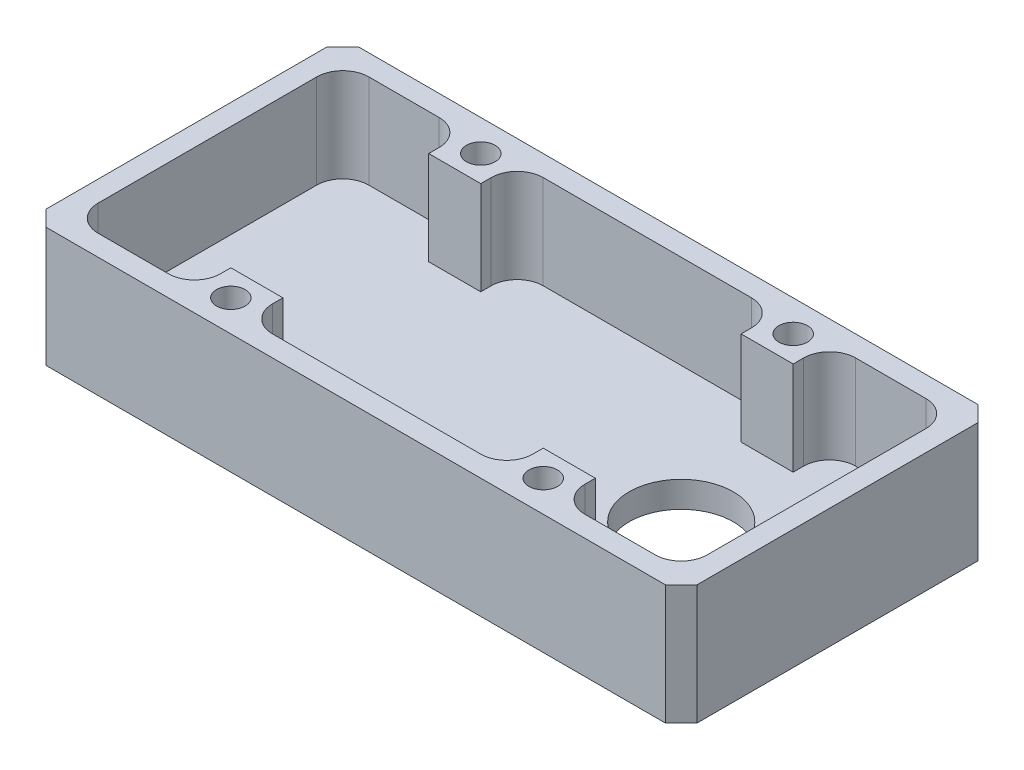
ISO-10303-21;
HEADER;
FILE_DESCRIPTION(('STEP AP214'),'2;1');
FILE_NAME('part.step','',(''),(''),'','','');
FILE_SCHEMA(('AUTOMOTIVE_DESIGN { 1 0 10303 214 1 1 1 1 }'));
ENDSEC;
DATA;
#1=APPLICATION_CONTEXT('core data for automotive mechanical design processes');
#2=APPLICATION_PROTOCOL_DEFINITION('international standard','automotive_design',2000,#1);
#3=PRODUCT_CONTEXT('',#1,'mechanical');
#4=PRODUCT('Part','Part','',(#3));
#5=PRODUCT_RELATED_PRODUCT_CATEGORY('part','',(#4));
#6=PRODUCT_DEFINITION_FORMATION('','',#4);
#7=PRODUCT_DEFINITION_CONTEXT('part definition',#1,'design');
#8=PRODUCT_DEFINITION('design','',#6,#7);
#9=PRODUCT_DEFINITION_SHAPE('','',#8);
#10=(LENGTH_UNIT() NAMED_UNIT(*) SI_UNIT(.MILLI.,.METRE.));
#11=(NAMED_UNIT(*) PLANE_ANGLE_UNIT() SI_UNIT($,.RADIAN.));
#12=(NAMED_UNIT(*) SI_UNIT($,.STERADIAN.) SOLID_ANGLE_UNIT());
#13=UNCERTAINTY_MEASURE_WITH_UNIT(LENGTH_MEASURE(1.E-05),#10,'distance_accuracy_value','');
#14=(GEOMETRIC_REPRESENTATION_CONTEXT(3) GLOBAL_UNCERTAINTY_ASSIGNED_CONTEXT((#13)) GLOBAL_UNIT_ASSIGNED_CONTEXT((#10,
#11,#12)) REPRESENTATION_CONTEXT('',''));
#15=CARTESIAN_POINT('',(0.,0.,0.));
#16=DIRECTION('',(0.,0.,1.));
#17=DIRECTION('',(1.,0.,0.));
#18=AXIS2_PLACEMENT_3D('',#15,#16,#17);
#19=CARTESIAN_POINT('',(-62.4999999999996,22.9999999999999,30.0000000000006));
#20=DIRECTION('',(0.999999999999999,0.,0.));
#21=DIRECTION('',(0.,0.,-1.));
#22=AXIS2_PLACEMENT_3D('',#19,#20,#21);
#23=PLANE('',#22);
#24=DIRECTION('',(0.,0.,1.));
#25=VECTOR('',#24,1.);
#26=CARTESIAN_POINT('',(-62.4999999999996,22.9999999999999,30.0000000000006));
#27=LINE('',#26,#25);
#28=CARTESIAN_POINT('',(-62.4999999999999,22.9999999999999,-26.9999999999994));
#29=VERTEX_POINT('',#28);
#30=CARTESIAN_POINT('',(-62.4999999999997,23.,27.0000000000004));
#31=VERTEX_POINT('',#30);
#32=EDGE_CURVE('E565',#29,#31,#27,.T.);
#33=ORIENTED_EDGE('',*,*,#32,.F.);
#34=DIRECTION('',(0.,-1.,0.));
#35=VECTOR('',#34,1.);
#36=CARTESIAN_POINT('',(-62.5,22.9999999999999,-26.9999999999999));
#37=LINE('',#36,#35);
#38=CARTESIAN_POINT('',(-62.5,0.,-26.9999999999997));
#39=VERTEX_POINT('',#38);
#40=EDGE_CURVE('E587',#29,#39,#37,.T.);
#41=ORIENTED_EDGE('',*,*,#40,.T.);
#42=DIRECTION('',(0.,0.,1.));
#43=VECTOR('',#42,1.);
#44=CARTESIAN_POINT('',(-62.5,0.,30.0000000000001));
#45=LINE('',#44,#43);
#46=CARTESIAN_POINT('',(-62.5000000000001,0.,27.0000000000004));
#47=VERTEX_POINT('',#46);
#48=EDGE_CURVE('E505',#39,#47,#45,.T.);
#49=ORIENTED_EDGE('',*,*,#48,.T.);
#50=DIRECTION('',(0.,1.,0.));
#51=VECTOR('',#50,1.);
#52=CARTESIAN_POINT('',(-62.4999999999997,23.0000000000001,27.0000000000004));
#53=LINE('',#52,#51);
#54=EDGE_CURVE('E576',#47,#31,#53,.T.);
#55=ORIENTED_EDGE('',*,*,#54,.T.);
#56=EDGE_LOOP('',(#33,#41,#49,#55));
#57=FACE_BOUND('',#56,.T.);
#58=ADVANCED_FACE('F36',(#57),#23,.F.);
#59=CARTESIAN_POINT('',(62.5000000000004,22.9999999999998,30.0000000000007));
#60=DIRECTION('',(0.,0.,-1.));
#61=DIRECTION('',(-1.,0.,0.));
#62=AXIS2_PLACEMENT_3D('',#59,#60,#61);
#63=PLANE('',#62);
#64=DIRECTION('',(1.,0.,0.));
#65=VECTOR('',#64,1.);
#66=CARTESIAN_POINT('',(62.4999999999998,0.,30.0000000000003));
#67=LINE('',#66,#65);
#68=CARTESIAN_POINT('',(-59.4999999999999,0.,30.));
#69=VERTEX_POINT('',#68);
#70=CARTESIAN_POINT('',(59.4999999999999,0.,30.0000000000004));
#71=VERTEX_POINT('',#70);
#72=EDGE_CURVE('E579',#69,#71,#67,.T.);
#73=ORIENTED_EDGE('',*,*,#72,.T.);
#74=DIRECTION('',(0.,1.,0.));
#75=VECTOR('',#74,1.);
#76=CARTESIAN_POINT('',(59.5000000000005,23.0000000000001,30.0000000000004));
#77=LINE('',#76,#75);
#78=CARTESIAN_POINT('',(59.5000000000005,23.0000000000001,30.0000000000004));
#79=VERTEX_POINT('',#78);
#80=EDGE_CURVE('E11',#71,#79,#77,.T.);
#81=ORIENTED_EDGE('',*,*,#80,.T.);
#82=DIRECTION('',(1.,0.,0.));
#83=VECTOR('',#82,1.);
#84=CARTESIAN_POINT('',(62.5000000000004,22.9999999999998,30.0000000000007));
#85=LINE('',#84,#83);
#86=CARTESIAN_POINT('',(-59.4999999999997,23.0000000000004,30.0000000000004));
#87=VERTEX_POINT('',#86);
#88=EDGE_CURVE('E568',#87,#79,#85,.T.);
#89=ORIENTED_EDGE('',*,*,#88,.F.);
#90=DIRECTION('',(0.,-1.,0.));
#91=VECTOR('',#90,1.);
#92=CARTESIAN_POINT('',(-59.4999999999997,23.0000000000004,30.0000000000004));
#93=LINE('',#92,#91);
#94=EDGE_CURVE('E44',#87,#69,#93,.T.);
#95=ORIENTED_EDGE('',*,*,#94,.T.);
#96=EDGE_LOOP('',(#73,#81,#89,#95));
#97=FACE_BOUND('',#96,.T.);
#98=ADVANCED_FACE('F618',(#97),#63,.F.);
#99=CARTESIAN_POINT('',(62.5000000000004,22.9999999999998,30.0000000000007));
#100=DIRECTION('',(-0.999999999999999,0.,0.));
#101=DIRECTION('',(0.,0.,1.));
#102=AXIS2_PLACEMENT_3D('',#99,#100,#101);
#103=PLANE('',#102);
#104=DIRECTION('',(0.,0.,-1.));
#105=VECTOR('',#104,1.);
#106=CARTESIAN_POINT('',(62.4999999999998,0.,30.0000000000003));
#107=LINE('',#106,#105);
#108=CARTESIAN_POINT('',(62.4999999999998,0.,27.));
#109=VERTEX_POINT('',#108);
#110=CARTESIAN_POINT('',(62.5000000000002,0.,-26.9999999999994));
#111=VERTEX_POINT('',#110);
#112=EDGE_CURVE('E582',#109,#111,#107,.T.);
#113=ORIENTED_EDGE('',*,*,#112,.T.);
#114=DIRECTION('',(0.,1.,0.));
#115=VECTOR('',#114,1.);
#116=CARTESIAN_POINT('',(62.5,23.0000000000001,-26.9999999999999));
#117=LINE('',#116,#115);
#118=CARTESIAN_POINT('',(62.5,23.0000000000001,-26.9999999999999));
#119=VERTEX_POINT('',#118);
#120=EDGE_CURVE('E51',#111,#119,#117,.T.);
#121=ORIENTED_EDGE('',*,*,#120,.T.);
#122=DIRECTION('',(0.,0.,-1.));
#123=VECTOR('',#122,1.);
#124=CARTESIAN_POINT('',(62.5000000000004,22.9999999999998,30.0000000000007));
#125=LINE('',#124,#123);
#126=CARTESIAN_POINT('',(62.5,22.9999999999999,27.));
#127=VERTEX_POINT('',#126);
#128=EDGE_CURVE('E571',#127,#119,#125,.T.);
#129=ORIENTED_EDGE('',*,*,#128,.F.);
#130=DIRECTION('',(0.,-1.,0.));
#131=VECTOR('',#130,1.);
#132=CARTESIAN_POINT('',(62.5,22.9999999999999,27.));
#133=LINE('',#132,#131);
#134=EDGE_CURVE('E610',#127,#109,#133,.T.);
#135=ORIENTED_EDGE('',*,*,#134,.T.);
#136=EDGE_LOOP('',(#113,#121,#129,#135));
#137=FACE_BOUND('',#136,.T.);
#138=ADVANCED_FACE('F629',(#137),#103,.F.);
#139=CARTESIAN_POINT('',(62.5,22.9999999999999,-29.9999999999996));
#140=DIRECTION('',(0.,0.,1.));
#141=DIRECTION('',(0.999999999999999,0.,0.));
#142=AXIS2_PLACEMENT_3D('',#139,#140,#141);
#143=PLANE('',#142);
#144=DIRECTION('',(-0.999999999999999,0.,0.));
#145=VECTOR('',#144,1.);
#146=CARTESIAN_POINT('',(62.5000000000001,-1.11022302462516E-13,-29.9999999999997));
#147=LINE('',#146,#145);
#148=CARTESIAN_POINT('',(59.5,0.,-29.9999999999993));
#149=VERTEX_POINT('',#148);
#150=CARTESIAN_POINT('',(-59.4999999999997,0.,-29.9999999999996));
#151=VERTEX_POINT('',#150);
#152=EDGE_CURVE('E569',#149,#151,#147,.T.);
#153=ORIENTED_EDGE('',*,*,#152,.T.);
#154=DIRECTION('',(0.,1.,0.));
#155=VECTOR('',#154,1.);
#156=CARTESIAN_POINT('',(-59.5,23.0000000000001,-29.9999999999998));
#157=LINE('',#156,#155);
#158=CARTESIAN_POINT('',(-59.5,23.0000000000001,-29.9999999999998));
#159=VERTEX_POINT('',#158);
#160=EDGE_CURVE('E601',#151,#159,#157,.T.);
#161=ORIENTED_EDGE('',*,*,#160,.T.);
#162=DIRECTION('',(-0.999999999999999,0.,0.));
#163=VECTOR('',#162,1.);
#164=CARTESIAN_POINT('',(62.5,22.9999999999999,-29.9999999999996));
#165=LINE('',#164,#163);
#166=CARTESIAN_POINT('',(59.4999999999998,22.9999999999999,-29.9999999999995));
#167=VERTEX_POINT('',#166);
#168=EDGE_CURVE('E573',#167,#159,#165,.T.);
#169=ORIENTED_EDGE('',*,*,#168,.F.);
#170=DIRECTION('',(0.,-1.,0.));
#171=VECTOR('',#170,1.);
#172=CARTESIAN_POINT('',(59.4999999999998,22.9999999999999,-29.9999999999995));
#173=LINE('',#172,#171);
#174=EDGE_CURVE('E598',#167,#149,#173,.T.);
#175=ORIENTED_EDGE('',*,*,#174,.T.);
#176=EDGE_LOOP('',(#153,#161,#169,#175));
#177=FACE_BOUND('',#176,.T.);
#178=ADVANCED_FACE('F638',(#177),#143,.F.);
#179=CARTESIAN_POINT('',(-2.4980018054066E-13,22.9999999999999,5.27355936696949E-13));
#180=DIRECTION('',(0.,1.,0.));
#181=DIRECTION('',(0.,0.,1.));
#182=AXIS2_PLACEMENT_3D('',#179,#180,#181);
#183=PLANE('',#182);
#184=CARTESIAN_POINT('',(30.,23.0000000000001,-23.9999999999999));
#185=DIRECTION('',(0.,1.,0.));
#186=DIRECTION('',(0.,0.,1.));
#187=AXIS2_PLACEMENT_3D('',#184,#185,#186);
#188=CIRCLE('',#187,2.75);
#189=CARTESIAN_POINT('',(30.,23.0000000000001,-21.2499999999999));
#190=VERTEX_POINT('',#189);
#191=EDGE_CURVE('E1009',#190,#190,#188,.T.);
#192=ORIENTED_EDGE('',*,*,#191,.F.);
#193=EDGE_LOOP('',(#192));
#194=FACE_BOUND('',#193,.T.);
#195=CARTESIAN_POINT('',(30.0000000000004,22.9999999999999,24.0000000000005));
#196=DIRECTION('',(0.,1.,0.));
#197=DIRECTION('',(0.,0.,-1.));
#198=AXIS2_PLACEMENT_3D('',#195,#196,#197);
#199=CIRCLE('',#198,2.75);
#200=CARTESIAN_POINT('',(30.0000000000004,22.9999999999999,21.2500000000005));
#201=VERTEX_POINT('',#200);
#202=EDGE_CURVE('E1013',#201,#201,#199,.T.);
#203=ORIENTED_EDGE('',*,*,#202,.F.);
#204=EDGE_LOOP('',(#203));
#205=FACE_BOUND('',#204,.T.);
#206=CARTESIAN_POINT('',(-30.0000000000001,23.0000000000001,-23.9999999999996));
#207=DIRECTION('',(0.,1.,0.));
#208=DIRECTION('',(0.,0.,-1.));
#209=AXIS2_PLACEMENT_3D('',#206,#207,#208);
#210=CIRCLE('',#209,2.75);
#211=CARTESIAN_POINT('',(-30.0000000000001,23.0000000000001,-26.7499999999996));
#212=VERTEX_POINT('',#211);
#213=EDGE_CURVE('E1017',#212,#212,#210,.T.);
#214=ORIENTED_EDGE('',*,*,#213,.F.);
#215=EDGE_LOOP('',(#214));
#216=FACE_BOUND('',#215,.T.);
#217=CARTESIAN_POINT('',(-29.9999999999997,23.0000000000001,24.0000000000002));
#218=DIRECTION('',(0.,1.,0.));
#219=DIRECTION('',(0.,0.,1.));
#220=AXIS2_PLACEMENT_3D('',#217,#218,#219);
#221=CIRCLE('',#220,2.75);
#222=CARTESIAN_POINT('',(-29.9999999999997,23.0000000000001,26.7500000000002));
#223=VERTEX_POINT('',#222);
#224=EDGE_CURVE('E325',#223,#223,#221,.T.);
#225=ORIENTED_EDGE('',*,*,#224,.F.);
#226=EDGE_LOOP('',(#225));
#227=FACE_BOUND('',#226,.T.);
#228=DIRECTION('',(-1.,0.,0.));
#229=VECTOR('',#228,1.);
#230=CARTESIAN_POINT('',(-34.9999999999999,23.0000000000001,-18.9999999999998));
#231=LINE('',#230,#229);
#232=CARTESIAN_POINT('',(-24.9999999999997,22.9999999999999,-18.9999999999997));
#233=VERTEX_POINT('',#232);
#234=CARTESIAN_POINT('',(-34.9999999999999,23.0000000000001,-18.9999999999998));
#235=VERTEX_POINT('',#234);
#236=EDGE_CURVE('E301',#233,#235,#231,.T.);
#237=ORIENTED_EDGE('',*,*,#236,.F.);
#238=DIRECTION('',(0.,0.,1.));
#239=VECTOR('',#238,1.);
#240=CARTESIAN_POINT('',(-24.9999999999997,22.9999999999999,-18.9999999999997));
#241=LINE('',#240,#239);
#242=CARTESIAN_POINT('',(-25.0000000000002,23.0000000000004,-20.9999999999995));
#243=VERTEX_POINT('',#242);
#244=EDGE_CURVE('E319',#243,#233,#241,.T.);
#245=ORIENTED_EDGE('',*,*,#244,.F.);
#246=CARTESIAN_POINT('',(-20.,23.0000000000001,-20.9999999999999));
#247=DIRECTION('',(0.,1.,0.));
#248=DIRECTION('',(0.,0.,-1.));
#249=AXIS2_PLACEMENT_3D('',#246,#247,#248);
#250=CIRCLE('',#249,5.);
#251=CARTESIAN_POINT('',(-19.9999999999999,23.0000000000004,-25.9999999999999));
#252=VERTEX_POINT('',#251);
#253=EDGE_CURVE('E322',#252,#243,#250,.T.);
#254=ORIENTED_EDGE('',*,*,#253,.F.);
#255=DIRECTION('',(-1.,0.,0.));
#256=VECTOR('',#255,1.);
#257=CARTESIAN_POINT('',(-19.9999999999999,23.0000000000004,-25.9999999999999));
#258=LINE('',#257,#256);
#259=CARTESIAN_POINT('',(19.9999999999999,23.,-25.9999999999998));
#260=VERTEX_POINT('',#259);
#261=EDGE_CURVE('E498',#260,#252,#258,.T.);
#262=ORIENTED_EDGE('',*,*,#261,.F.);
#263=CARTESIAN_POINT('',(20.,23.0000000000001,-20.9999999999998));
#264=DIRECTION('',(0.,1.,0.));
#265=DIRECTION('',(0.,0.,1.));
#266=AXIS2_PLACEMENT_3D('',#263,#264,#265);
#267=CIRCLE('',#266,5.);
#268=CARTESIAN_POINT('',(25.0000000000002,22.9999999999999,-20.9999999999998));
#269=VERTEX_POINT('',#268);
#270=EDGE_CURVE('E495',#269,#260,#267,.T.);
#271=ORIENTED_EDGE('',*,*,#270,.F.);
#272=DIRECTION('',(0.,0.,-1.));
#273=VECTOR('',#272,1.);
#274=CARTESIAN_POINT('',(24.9999999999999,23.0000000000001,-18.9999999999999));
#275=LINE('',#274,#273);
#276=CARTESIAN_POINT('',(24.9999999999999,23.0000000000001,-18.9999999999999));
#277=VERTEX_POINT('',#276);
#278=EDGE_CURVE('E492',#277,#269,#275,.T.);
#279=ORIENTED_EDGE('',*,*,#278,.F.);
#280=DIRECTION('',(-1.,0.,0.));
#281=VECTOR('',#280,1.);
#282=CARTESIAN_POINT('',(35.,23.0000000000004,-18.9999999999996));
#283=LINE('',#282,#281);
#284=CARTESIAN_POINT('',(35.,23.0000000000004,-18.9999999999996));
#285=VERTEX_POINT('',#284);
#286=EDGE_CURVE('E489',#285,#277,#283,.T.);
#287=ORIENTED_EDGE('',*,*,#286,.F.);
#288=DIRECTION('',(0.,0.,1.));
#289=VECTOR('',#288,1.);
#290=CARTESIAN_POINT('',(35.,23.,-20.9999999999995));
#291=LINE('',#290,#289);
#292=CARTESIAN_POINT('',(35.,23.,-20.9999999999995));
#293=VERTEX_POINT('',#292);
#294=EDGE_CURVE('E486',#293,#285,#291,.T.);
#295=ORIENTED_EDGE('',*,*,#294,.F.);
#296=CARTESIAN_POINT('',(40.0000000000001,22.9999999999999,-20.9999999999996));
#297=DIRECTION('',(0.,1.,0.));
#298=DIRECTION('',(0.,0.,-1.));
#299=AXIS2_PLACEMENT_3D('',#296,#297,#298);
#300=CIRCLE('',#299,5.);
#301=CARTESIAN_POINT('',(40.0000000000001,22.9999999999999,-25.9999999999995));
#302=VERTEX_POINT('',#301);
#303=EDGE_CURVE('E483',#302,#293,#300,.T.);
#304=ORIENTED_EDGE('',*,*,#303,.F.);
#305=DIRECTION('',(-1.,0.,0.));
#306=VECTOR('',#305,1.);
#307=CARTESIAN_POINT('',(53.5,23.0000000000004,-25.9999999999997));
#308=LINE('',#307,#306);
#309=CARTESIAN_POINT('',(53.5,23.0000000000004,-25.9999999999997));
#310=VERTEX_POINT('',#309);
#311=EDGE_CURVE('E480',#310,#302,#308,.T.);
#312=ORIENTED_EDGE('',*,*,#311,.F.);
#313=CARTESIAN_POINT('',(53.4999999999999,23.0000000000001,-20.9999999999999));
#314=DIRECTION('',(0.,1.,0.));
#315=DIRECTION('',(0.,0.,-1.));
#316=AXIS2_PLACEMENT_3D('',#313,#314,#315);
#317=CIRCLE('',#316,5.);
#318=CARTESIAN_POINT('',(58.4999999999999,22.9999999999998,-20.9999999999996));
#319=VERTEX_POINT('',#318);
#320=EDGE_CURVE('E477',#319,#310,#317,.T.);
#321=ORIENTED_EDGE('',*,*,#320,.F.);
#322=DIRECTION('',(0.,0.,-1.));
#323=VECTOR('',#322,1.);
#324=CARTESIAN_POINT('',(58.5000000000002,23.0000000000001,21.0000000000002));
#325=LINE('',#324,#323);
#326=CARTESIAN_POINT('',(58.5000000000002,23.0000000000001,21.0000000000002));
#327=VERTEX_POINT('',#326);
#328=EDGE_CURVE('E474',#327,#319,#325,.T.);
#329=ORIENTED_EDGE('',*,*,#328,.F.);
#330=CARTESIAN_POINT('',(53.5000000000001,23.0000000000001,21.0000000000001));
#331=DIRECTION('',(0.,1.,0.));
#332=DIRECTION('',(0.,0.,1.));
#333=AXIS2_PLACEMENT_3D('',#330,#331,#332);
#334=CIRCLE('',#333,5.);
#335=CARTESIAN_POINT('',(53.5000000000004,23.0000000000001,26.0000000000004));
#336=VERTEX_POINT('',#335);
#337=EDGE_CURVE('E471',#336,#327,#334,.T.);
#338=ORIENTED_EDGE('',*,*,#337,.F.);
#339=DIRECTION('',(1.,0.,0.));
#340=VECTOR('',#339,1.);
#341=CARTESIAN_POINT('',(53.5000000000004,23.0000000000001,26.0000000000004));
#342=LINE('',#341,#340);
#343=CARTESIAN_POINT('',(40.,23.0000000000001,26.0000000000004));
#344=VERTEX_POINT('',#343);
#345=EDGE_CURVE('E468',#344,#336,#342,.T.);
#346=ORIENTED_EDGE('',*,*,#345,.F.);
#347=CARTESIAN_POINT('',(40.0000000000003,23.0000000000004,21.0000000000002));
#348=DIRECTION('',(0.,1.,0.));
#349=DIRECTION('',(0.,0.,-1.));
#350=AXIS2_PLACEMENT_3D('',#347,#348,#349);
#351=CIRCLE('',#350,5.);
#352=CARTESIAN_POINT('',(35.0000000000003,22.9999999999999,21.0000000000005));
#353=VERTEX_POINT('',#352);
#354=EDGE_CURVE('E465',#353,#344,#351,.T.);
#355=ORIENTED_EDGE('',*,*,#354,.F.);
#356=DIRECTION('',(0.,0.,1.));
#357=VECTOR('',#356,1.);
#358=CARTESIAN_POINT('',(35.0000000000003,22.9999999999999,21.0000000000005));
#359=LINE('',#358,#357);
#360=CARTESIAN_POINT('',(35.0000000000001,23.0000000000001,19.0000000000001));
#361=VERTEX_POINT('',#360);
#362=EDGE_CURVE('E462',#361,#353,#359,.T.);
#363=ORIENTED_EDGE('',*,*,#362,.F.);
#364=DIRECTION('',(1.,0.,0.));
#365=VECTOR('',#364,1.);
#366=CARTESIAN_POINT('',(35.0000000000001,23.0000000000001,19.0000000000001));
#367=LINE('',#366,#365);
#368=CARTESIAN_POINT('',(25.0000000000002,23.0000000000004,19.0000000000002));
#369=VERTEX_POINT('',#368);
#370=EDGE_CURVE('E459',#369,#361,#367,.T.);
#371=ORIENTED_EDGE('',*,*,#370,.F.);
#372=DIRECTION('',(0.,0.,-1.));
#373=VECTOR('',#372,1.);
#374=CARTESIAN_POINT('',(25.0000000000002,23.0000000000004,19.0000000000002));
#375=LINE('',#374,#373);
#376=CARTESIAN_POINT('',(25.0000000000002,23.0000000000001,21.0000000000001));
#377=VERTEX_POINT('',#376);
#378=EDGE_CURVE('E456',#377,#369,#375,.T.);
#379=ORIENTED_EDGE('',*,*,#378,.F.);
#380=CARTESIAN_POINT('',(20.,23.0000000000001,21.0000000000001));
#381=DIRECTION('',(0.,1.,0.));
#382=DIRECTION('',(0.,0.,-1.));
#383=AXIS2_PLACEMENT_3D('',#380,#381,#382);
#384=CIRCLE('',#383,5.);
#385=CARTESIAN_POINT('',(20.0000000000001,23.0000000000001,26.0000000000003));
#386=VERTEX_POINT('',#385);
#387=EDGE_CURVE('E453',#386,#377,#384,.T.);
#388=ORIENTED_EDGE('',*,*,#387,.F.);
#389=DIRECTION('',(1.,0.,0.));
#390=VECTOR('',#389,1.);
#391=CARTESIAN_POINT('',(-19.9999999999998,22.9999999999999,26.0000000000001));
#392=LINE('',#391,#390);
#393=CARTESIAN_POINT('',(-19.9999999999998,22.9999999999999,26.0000000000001));
#394=VERTEX_POINT('',#393);
#395=EDGE_CURVE('E450',#394,#386,#392,.T.);
#396=ORIENTED_EDGE('',*,*,#395,.F.);
#397=CARTESIAN_POINT('',(-20.0000000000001,22.9999999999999,21.0000000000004));
#398=DIRECTION('',(0.,1.,0.));
#399=DIRECTION('',(0.,0.,-1.));
#400=AXIS2_PLACEMENT_3D('',#397,#398,#399);
#401=CIRCLE('',#400,5.);
#402=CARTESIAN_POINT('',(-24.9999999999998,23.0000000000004,21.0000000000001));
#403=VERTEX_POINT('',#402);
#404=EDGE_CURVE('E447',#403,#394,#401,.T.);
#405=ORIENTED_EDGE('',*,*,#404,.F.);
#406=DIRECTION('',(0.,0.,1.));
#407=VECTOR('',#406,1.);
#408=CARTESIAN_POINT('',(-24.9999999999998,23.0000000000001,19.0000000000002));
#409=LINE('',#408,#407);
#410=CARTESIAN_POINT('',(-24.9999999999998,23.0000000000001,19.0000000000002));
#411=VERTEX_POINT('',#410);
#412=EDGE_CURVE('E444',#411,#403,#409,.T.);
#413=ORIENTED_EDGE('',*,*,#412,.F.);
#414=DIRECTION('',(1.,0.,0.));
#415=VECTOR('',#414,1.);
#416=CARTESIAN_POINT('',(-35.,22.9999999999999,19.0000000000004));
#417=LINE('',#416,#415);
#418=CARTESIAN_POINT('',(-35.,22.9999999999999,19.0000000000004));
#419=VERTEX_POINT('',#418);
#420=EDGE_CURVE('E441',#419,#411,#417,.T.);
#421=ORIENTED_EDGE('',*,*,#420,.F.);
#422=DIRECTION('',(0.,0.,-1.));
#423=VECTOR('',#422,1.);
#424=CARTESIAN_POINT('',(-34.9999999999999,23.0000000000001,21.));
#425=LINE('',#424,#423);
#426=CARTESIAN_POINT('',(-34.9999999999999,23.0000000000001,21.));
#427=VERTEX_POINT('',#426);
#428=EDGE_CURVE('E438',#427,#419,#425,.T.);
#429=ORIENTED_EDGE('',*,*,#428,.F.);
#430=CARTESIAN_POINT('',(-39.9999999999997,23.0000000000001,21.0000000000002));
#431=DIRECTION('',(0.,1.,0.));
#432=DIRECTION('',(0.,0.,-1.));
#433=AXIS2_PLACEMENT_3D('',#430,#431,#432);
#434=CIRCLE('',#433,5.);
#435=CARTESIAN_POINT('',(-40.,23.0000000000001,26.0000000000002));
#436=VERTEX_POINT('',#435);
#437=EDGE_CURVE('E435',#436,#427,#434,.T.);
#438=ORIENTED_EDGE('',*,*,#437,.F.);
#439=DIRECTION('',(1.,0.,0.));
#440=VECTOR('',#439,1.);
#441=CARTESIAN_POINT('',(-53.4999999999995,23.0000000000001,26.0000000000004));
#442=LINE('',#441,#440);
#443=CARTESIAN_POINT('',(-53.4999999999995,23.0000000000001,26.0000000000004));
#444=VERTEX_POINT('',#443);
#445=EDGE_CURVE('E432',#444,#436,#442,.T.);
#446=ORIENTED_EDGE('',*,*,#445,.F.);
#447=CARTESIAN_POINT('',(-53.4999999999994,23.0000000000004,21.0000000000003));
#448=DIRECTION('',(0.,1.,0.));
#449=DIRECTION('',(0.,0.,-1.));
#450=AXIS2_PLACEMENT_3D('',#447,#448,#449);
#451=CIRCLE('',#450,5.);
#452=CARTESIAN_POINT('',(-58.4999999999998,23.0000000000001,21.));
#453=VERTEX_POINT('',#452);
#454=EDGE_CURVE('E429',#453,#444,#451,.T.);
#455=ORIENTED_EDGE('',*,*,#454,.F.);
#456=DIRECTION('',(0.,0.,1.));
#457=VECTOR('',#456,1.);
#458=CARTESIAN_POINT('',(-58.4999999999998,23.0000000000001,21.));
#459=LINE('',#458,#457);
#460=CARTESIAN_POINT('',(-58.4999999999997,23.,-20.9999999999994));
#461=VERTEX_POINT('',#460);
#462=EDGE_CURVE('E426',#461,#453,#459,.T.);
#463=ORIENTED_EDGE('',*,*,#462,.F.);
#464=CARTESIAN_POINT('',(-53.4999999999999,23.0000000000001,-20.9999999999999));
#465=DIRECTION('',(0.,1.,0.));
#466=DIRECTION('',(0.,0.,-1.));
#467=AXIS2_PLACEMENT_3D('',#464,#465,#466);
#468=CIRCLE('',#467,5.);
#469=CARTESIAN_POINT('',(-53.5000000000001,23.0000000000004,-25.9999999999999));
#470=VERTEX_POINT('',#469);
#471=EDGE_CURVE('E423',#470,#461,#468,.T.);
#472=ORIENTED_EDGE('',*,*,#471,.F.);
#473=DIRECTION('',(-1.,0.,0.));
#474=VECTOR('',#473,1.);
#475=CARTESIAN_POINT('',(-53.5000000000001,23.0000000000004,-25.9999999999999));
#476=LINE('',#475,#474);
#477=CARTESIAN_POINT('',(-40.0000000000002,22.9999999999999,-25.9999999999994));
#478=VERTEX_POINT('',#477);
#479=EDGE_CURVE('E420',#478,#470,#476,.T.);
#480=ORIENTED_EDGE('',*,*,#479,.F.);
#481=CARTESIAN_POINT('',(-39.9999999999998,22.9999999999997,-20.9999999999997));
#482=DIRECTION('',(0.,1.,0.));
#483=DIRECTION('',(0.,0.,-1.));
#484=AXIS2_PLACEMENT_3D('',#481,#482,#483);
#485=CIRCLE('',#484,5.);
#486=CARTESIAN_POINT('',(-35.0000000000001,23.0000000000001,-20.9999999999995));
#487=VERTEX_POINT('',#486);
#488=EDGE_CURVE('E417',#487,#478,#485,.T.);
#489=ORIENTED_EDGE('',*,*,#488,.F.);
#490=DIRECTION('',(0.,0.,-1.));
#491=VECTOR('',#490,1.);
#492=CARTESIAN_POINT('',(-35.0000000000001,23.0000000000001,-20.9999999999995));
#493=LINE('',#492,#491);
#494=EDGE_CURVE('E414',#235,#487,#493,.T.);
#495=ORIENTED_EDGE('',*,*,#494,.F.);
#496=EDGE_LOOP('',(#237,#245,#254,#262,#271,#279,#287,#295,#304,#312,#321,#329,#338,#346,#355,
#363,#371,#379,#388,#396,#405,#413,#421,#429,#438,#446,#455,#463,#472,#480,#489,#495));
#497=FACE_BOUND('',#496,.T.);
#498=ORIENTED_EDGE('',*,*,#168,.T.);
#499=DIRECTION('',(0.707106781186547,0.,-0.707106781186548));
#500=VECTOR('',#499,1.);
#501=CARTESIAN_POINT('',(-44.7500000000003,22.9999999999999,-44.7499999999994));
#502=LINE('',#501,#500);
#503=EDGE_CURVE('E608',#159,#29,#502,.F.);
#504=ORIENTED_EDGE('',*,*,#503,.T.);
#505=ORIENTED_EDGE('',*,*,#32,.T.);
#506=DIRECTION('',(-0.707106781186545,0.,-0.707106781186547));
#507=VECTOR('',#506,1.);
#508=CARTESIAN_POINT('',(-44.75,22.9999999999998,44.7500000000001));
#509=LINE('',#508,#507);
#510=EDGE_CURVE('E603',#31,#87,#509,.F.);
#511=ORIENTED_EDGE('',*,*,#510,.T.);
#512=ORIENTED_EDGE('',*,*,#88,.T.);
#513=DIRECTION('',(-0.707106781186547,0.,0.707106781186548));
#514=VECTOR('',#513,1.);
#515=CARTESIAN_POINT('',(44.7499999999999,23.0000000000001,44.7500000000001));
#516=LINE('',#515,#514);
#517=EDGE_CURVE('E58',#79,#127,#516,.F.);
#518=ORIENTED_EDGE('',*,*,#517,.T.);
#519=ORIENTED_EDGE('',*,*,#128,.T.);
#520=DIRECTION('',(0.707106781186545,0.,0.707106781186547));
#521=VECTOR('',#520,1.);
#522=CARTESIAN_POINT('',(44.7499999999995,23.0000000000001,-44.7499999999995));
#523=LINE('',#522,#521);
#524=EDGE_CURVE('E606',#119,#167,#523,.F.);
#525=ORIENTED_EDGE('',*,*,#524,.T.);
#526=EDGE_LOOP('',(#498,#504,#505,#511,#512,#518,#519,#525));
#527=FACE_BOUND('',#526,.T.);
#528=ADVANCED_FACE('F631',(#194,#205,#216,#227,#497,#527),#183,.T.);
#529=CARTESIAN_POINT('',(0.,0.,0.));
#530=DIRECTION('',(0.,1.,0.));
#531=DIRECTION('',(0.,0.,1.));
#532=AXIS2_PLACEMENT_3D('',#529,#530,#531);
#533=PLANE('',#532);
#534=CARTESIAN_POINT('',(32.5,0.,0.));
#535=DIRECTION('',(0.,1.,0.));
#536=DIRECTION('',(0.,0.,1.));
#537=AXIS2_PLACEMENT_3D('',#534,#535,#536);
#538=CIRCLE('',#537,10.);
#539=CARTESIAN_POINT('',(32.5,0.,10.0000000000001));
#540=VERTEX_POINT('',#539);
#541=EDGE_CURVE('E1094',#540,#540,#538,.T.);
#542=ORIENTED_EDGE('',*,*,#541,.T.);
#543=EDGE_LOOP('',(#542));
#544=FACE_BOUND('',#543,.T.);
#545=CARTESIAN_POINT('',(30.0000000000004,0.,-23.9999999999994));
#546=DIRECTION('',(0.,1.,0.));
#547=DIRECTION('',(0.,0.,1.));
#548=AXIS2_PLACEMENT_3D('',#545,#546,#547);
#549=CIRCLE('',#548,2.75);
#550=CARTESIAN_POINT('',(30.0000000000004,0.,-21.2499999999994));
#551=VERTEX_POINT('',#550);
#552=EDGE_CURVE('E1090',#551,#551,#549,.T.);
#553=ORIENTED_EDGE('',*,*,#552,.T.);
#554=EDGE_LOOP('',(#553));
#555=FACE_BOUND('',#554,.T.);
#556=CARTESIAN_POINT('',(29.9999999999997,0.,24.0000000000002));
#557=DIRECTION('',(0.,1.,0.));
#558=DIRECTION('',(0.,0.,-1.));
#559=AXIS2_PLACEMENT_3D('',#556,#557,#558);
#560=CIRCLE('',#559,2.75);
#561=CARTESIAN_POINT('',(29.9999999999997,0.,21.2500000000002));
#562=VERTEX_POINT('',#561);
#563=EDGE_CURVE('E1086',#562,#562,#560,.T.);
#564=ORIENTED_EDGE('',*,*,#563,.T.);
#565=EDGE_LOOP('',(#564));
#566=FACE_BOUND('',#565,.T.);
#567=CARTESIAN_POINT('',(-29.9999999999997,0.,-23.9999999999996));
#568=DIRECTION('',(0.,1.,0.));
#569=DIRECTION('',(0.,0.,-1.));
#570=AXIS2_PLACEMENT_3D('',#567,#568,#569);
#571=CIRCLE('',#570,2.75);
#572=CARTESIAN_POINT('',(-29.9999999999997,0.,-26.7499999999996));
#573=VERTEX_POINT('',#572);
#574=EDGE_CURVE('E1080',#573,#573,#571,.T.);
#575=ORIENTED_EDGE('',*,*,#574,.T.);
#576=EDGE_LOOP('',(#575));
#577=FACE_BOUND('',#576,.T.);
#578=CARTESIAN_POINT('',(-30.0000000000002,0.,24.0000000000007));
#579=DIRECTION('',(0.,1.,0.));
#580=DIRECTION('',(0.,0.,1.));
#581=AXIS2_PLACEMENT_3D('',#578,#579,#580);
#582=CIRCLE('',#581,2.75);
#583=CARTESIAN_POINT('',(-30.0000000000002,0.,26.7500000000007));
#584=VERTEX_POINT('',#583);
#585=EDGE_CURVE('E415',#584,#584,#582,.T.);
#586=ORIENTED_EDGE('',*,*,#585,.T.);
#587=EDGE_LOOP('',(#586));
#588=FACE_BOUND('',#587,.T.);
#589=ORIENTED_EDGE('',*,*,#48,.F.);
#590=DIRECTION('',(-0.707106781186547,0.,0.707106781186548));
#591=VECTOR('',#590,1.);
#592=CARTESIAN_POINT('',(-62.4999999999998,0.,-26.9999999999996));
#593=LINE('',#592,#591);
#594=EDGE_CURVE('E596',#39,#151,#593,.F.);
#595=ORIENTED_EDGE('',*,*,#594,.T.);
#596=ORIENTED_EDGE('',*,*,#152,.F.);
#597=DIRECTION('',(-0.707106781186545,0.,-0.707106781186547));
#598=VECTOR('',#597,1.);
#599=CARTESIAN_POINT('',(59.5,0.,-29.9999999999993));
#600=LINE('',#599,#598);
#601=EDGE_CURVE('E594',#149,#111,#600,.F.);
#602=ORIENTED_EDGE('',*,*,#601,.T.);
#603=ORIENTED_EDGE('',*,*,#112,.F.);
#604=DIRECTION('',(0.707106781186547,0.,-0.707106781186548));
#605=VECTOR('',#604,1.);
#606=CARTESIAN_POINT('',(62.4999999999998,0.,27.));
#607=LINE('',#606,#605);
#608=EDGE_CURVE('E592',#109,#71,#607,.F.);
#609=ORIENTED_EDGE('',*,*,#608,.T.);
#610=ORIENTED_EDGE('',*,*,#72,.F.);
#611=DIRECTION('',(0.707106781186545,0.,0.707106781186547));
#612=VECTOR('',#611,1.);
#613=CARTESIAN_POINT('',(-59.4999999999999,0.,30.0000000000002));
#614=LINE('',#613,#612);
#615=EDGE_CURVE('E590',#69,#47,#614,.F.);
#616=ORIENTED_EDGE('',*,*,#615,.T.);
#617=EDGE_LOOP('',(#589,#595,#596,#602,#603,#609,#610,#616));
#618=FACE_BOUND('',#617,.T.);
#619=ADVANCED_FACE('F624',(#544,#555,#566,#577,#588,#618),#533,.F.);
#620=CARTESIAN_POINT('',(-35.0000000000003,5.00000000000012,-18.9999999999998));
#621=DIRECTION('',(0.,0.,-1.));
#622=DIRECTION('',(-1.,0.,0.));
#623=AXIS2_PLACEMENT_3D('',#620,#621,#622);
#624=PLANE('',#623);
#625=ORIENTED_EDGE('',*,*,#236,.T.);
#626=DIRECTION('',(0.,1.,0.));
#627=VECTOR('',#626,1.);
#628=CARTESIAN_POINT('',(-35.0000000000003,5.00000000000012,-18.9999999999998));
#629=LINE('',#628,#627);
#630=CARTESIAN_POINT('',(-35.0000000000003,5.00000000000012,-18.9999999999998));
#631=VERTEX_POINT('',#630);
#632=EDGE_CURVE('E294',#631,#235,#629,.T.);
#633=ORIENTED_EDGE('',*,*,#632,.F.);
#634=DIRECTION('',(-1.,0.,0.));
#635=VECTOR('',#634,1.);
#636=CARTESIAN_POINT('',(-35.0000000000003,5.00000000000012,-18.9999999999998));
#637=LINE('',#636,#635);
#638=CARTESIAN_POINT('',(-25.0000000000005,4.99999999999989,-18.9999999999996));
#639=VERTEX_POINT('',#638);
#640=EDGE_CURVE('E298',#639,#631,#637,.T.);
#641=ORIENTED_EDGE('',*,*,#640,.F.);
#642=DIRECTION('',(0.,1.,0.));
#643=VECTOR('',#642,1.);
#644=CARTESIAN_POINT('',(-25.0000000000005,4.99999999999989,-18.9999999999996));
#645=LINE('',#644,#643);
#646=EDGE_CURVE('E503',#639,#233,#645,.T.);
#647=ORIENTED_EDGE('',*,*,#646,.T.);
#648=EDGE_LOOP('',(#625,#633,#641,#647));
#649=FACE_BOUND('',#648,.T.);
#650=ADVANCED_FACE('F296',(#649),#624,.F.);
#651=CARTESIAN_POINT('',(-25.0000000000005,4.99999999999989,-18.9999999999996));
#652=DIRECTION('',(-0.999999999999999,0.,0.));
#653=DIRECTION('',(0.,0.,1.));
#654=AXIS2_PLACEMENT_3D('',#651,#652,#653);
#655=PLANE('',#654);
#656=ORIENTED_EDGE('',*,*,#244,.T.);
#657=ORIENTED_EDGE('',*,*,#646,.F.);
#658=DIRECTION('',(0.,0.,1.));
#659=VECTOR('',#658,1.);
#660=CARTESIAN_POINT('',(-25.0000000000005,4.99999999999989,-18.9999999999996));
#661=LINE('',#660,#659);
#662=CARTESIAN_POINT('',(-24.9999999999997,4.99999999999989,-20.9999999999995));
#663=VERTEX_POINT('',#662);
#664=EDGE_CURVE('E306',#663,#639,#661,.T.);
#665=ORIENTED_EDGE('',*,*,#664,.F.);
#666=DIRECTION('',(0.,1.,0.));
#667=VECTOR('',#666,1.);
#668=CARTESIAN_POINT('',(-24.9999999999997,4.99999999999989,-20.9999999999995));
#669=LINE('',#668,#667);
#670=EDGE_CURVE('E506',#663,#243,#669,.T.);
#671=ORIENTED_EDGE('',*,*,#670,.T.);
#672=EDGE_LOOP('',(#656,#657,#665,#671));
#673=FACE_BOUND('',#672,.T.);
#674=ADVANCED_FACE('F958',(#673),#655,.F.);
#675=CARTESIAN_POINT('',(-19.9999999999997,5.00000000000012,-20.9999999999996));
#676=DIRECTION('',(0.,1.,0.));
#677=DIRECTION('',(0.,0.,1.));
#678=AXIS2_PLACEMENT_3D('',#675,#676,#677);
#679=CYLINDRICAL_SURFACE('',#678,5.);
#680=ORIENTED_EDGE('',*,*,#253,.T.);
#681=ORIENTED_EDGE('',*,*,#670,.F.);
#682=CARTESIAN_POINT('',(-19.9999999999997,5.00000000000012,-20.9999999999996));
#683=DIRECTION('',(0.,1.,0.));
#684=DIRECTION('',(0.,0.,-1.));
#685=AXIS2_PLACEMENT_3D('',#682,#683,#684);
#686=CIRCLE('',#685,5.);
#687=CARTESIAN_POINT('',(-19.9999999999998,4.99999999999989,-25.9999999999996));
#688=VERTEX_POINT('',#687);
#689=EDGE_CURVE('E410',#688,#663,#686,.T.);
#690=ORIENTED_EDGE('',*,*,#689,.F.);
#691=DIRECTION('',(0.,1.,0.));
#692=VECTOR('',#691,1.);
#693=CARTESIAN_POINT('',(-19.9999999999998,4.99999999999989,-25.9999999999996));
#694=LINE('',#693,#692);
#695=EDGE_CURVE('E508',#688,#252,#694,.T.);
#696=ORIENTED_EDGE('',*,*,#695,.T.);
#697=EDGE_LOOP('',(#680,#681,#690,#696));
#698=FACE_BOUND('',#697,.T.);
#699=ADVANCED_FACE('F950',(#698),#679,.F.);
#700=CARTESIAN_POINT('',(-19.9999999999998,4.99999999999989,-25.9999999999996));
#701=DIRECTION('',(0.,0.,-1.));
#702=DIRECTION('',(-1.,0.,0.));
#703=AXIS2_PLACEMENT_3D('',#700,#701,#702);
#704=PLANE('',#703);
#705=ORIENTED_EDGE('',*,*,#261,.T.);
#706=ORIENTED_EDGE('',*,*,#695,.F.);
#707=DIRECTION('',(-1.,0.,0.));
#708=VECTOR('',#707,1.);
#709=CARTESIAN_POINT('',(-19.9999999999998,4.99999999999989,-25.9999999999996));
#710=LINE('',#709,#708);
#711=CARTESIAN_POINT('',(20.0000000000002,4.99999999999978,-25.9999999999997));
#712=VERTEX_POINT('',#711);
#713=EDGE_CURVE('E407',#712,#688,#710,.T.);
#714=ORIENTED_EDGE('',*,*,#713,.F.);
#715=DIRECTION('',(0.,1.,0.));
#716=VECTOR('',#715,1.);
#717=CARTESIAN_POINT('',(20.0000000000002,4.99999999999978,-25.9999999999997));
#718=LINE('',#717,#716);
#719=EDGE_CURVE('E510',#712,#260,#718,.T.);
#720=ORIENTED_EDGE('',*,*,#719,.T.);
#721=EDGE_LOOP('',(#705,#706,#714,#720));
#722=FACE_BOUND('',#721,.T.);
#723=ADVANCED_FACE('F942',(#722),#704,.F.);
#724=CARTESIAN_POINT('',(20.0000000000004,5.,-20.9999999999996));
#725=DIRECTION('',(0.,1.,0.));
#726=DIRECTION('',(0.,0.,1.));
#727=AXIS2_PLACEMENT_3D('',#724,#725,#726);
#728=CYLINDRICAL_SURFACE('',#727,5.);
#729=ORIENTED_EDGE('',*,*,#270,.T.);
#730=ORIENTED_EDGE('',*,*,#719,.F.);
#731=CARTESIAN_POINT('',(20.0000000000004,5.,-20.9999999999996));
#732=DIRECTION('',(0.,1.,0.));
#733=DIRECTION('',(0.,0.,1.));
#734=AXIS2_PLACEMENT_3D('',#731,#732,#733);
#735=CIRCLE('',#734,5.);
#736=CARTESIAN_POINT('',(25.0000000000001,4.99999999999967,-20.9999999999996));
#737=VERTEX_POINT('',#736);
#738=EDGE_CURVE('E404',#737,#712,#735,.T.);
#739=ORIENTED_EDGE('',*,*,#738,.F.);
#740=DIRECTION('',(0.,1.,0.));
#741=VECTOR('',#740,1.);
#742=CARTESIAN_POINT('',(25.0000000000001,4.99999999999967,-20.9999999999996));
#743=LINE('',#742,#741);
#744=EDGE_CURVE('E512',#737,#269,#743,.T.);
#745=ORIENTED_EDGE('',*,*,#744,.T.);
#746=EDGE_LOOP('',(#729,#730,#739,#745));
#747=FACE_BOUND('',#746,.T.);
#748=ADVANCED_FACE('F934',(#747),#728,.F.);
#749=CARTESIAN_POINT('',(24.9999999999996,5.00000000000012,-18.9999999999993));
#750=DIRECTION('',(1.,0.,0.));
#751=DIRECTION('',(0.,0.,-1.));
#752=AXIS2_PLACEMENT_3D('',#749,#750,#751);
#753=PLANE('',#752);
#754=ORIENTED_EDGE('',*,*,#278,.T.);
#755=ORIENTED_EDGE('',*,*,#744,.F.);
#756=DIRECTION('',(0.,0.,-1.));
#757=VECTOR('',#756,1.);
#758=CARTESIAN_POINT('',(24.9999999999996,5.00000000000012,-18.9999999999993));
#759=LINE('',#758,#757);
#760=CARTESIAN_POINT('',(24.9999999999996,5.00000000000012,-18.9999999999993));
#761=VERTEX_POINT('',#760);
#762=EDGE_CURVE('E401',#761,#737,#759,.T.);
#763=ORIENTED_EDGE('',*,*,#762,.F.);
#764=DIRECTION('',(0.,1.,0.));
#765=VECTOR('',#764,1.);
#766=CARTESIAN_POINT('',(24.9999999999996,5.00000000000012,-18.9999999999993));
#767=LINE('',#766,#765);
#768=EDGE_CURVE('E514',#761,#277,#767,.T.);
#769=ORIENTED_EDGE('',*,*,#768,.T.);
#770=EDGE_LOOP('',(#754,#755,#763,#769));
#771=FACE_BOUND('',#770,.T.);
#772=ADVANCED_FACE('F926',(#771),#753,.F.);
#773=CARTESIAN_POINT('',(34.9999999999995,5.00000000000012,-18.9999999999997));
#774=DIRECTION('',(0.,0.,-1.));
#775=DIRECTION('',(-1.,0.,0.));
#776=AXIS2_PLACEMENT_3D('',#773,#774,#775);
#777=PLANE('',#776);
#778=ORIENTED_EDGE('',*,*,#286,.T.);
#779=ORIENTED_EDGE('',*,*,#768,.F.);
#780=DIRECTION('',(-1.,0.,0.));
#781=VECTOR('',#780,1.);
#782=CARTESIAN_POINT('',(34.9999999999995,5.00000000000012,-18.9999999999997));
#783=LINE('',#782,#781);
#784=CARTESIAN_POINT('',(34.9999999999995,5.00000000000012,-18.9999999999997));
#785=VERTEX_POINT('',#784);
#786=EDGE_CURVE('E398',#785,#761,#783,.T.);
#787=ORIENTED_EDGE('',*,*,#786,.F.);
#788=DIRECTION('',(0.,1.,0.));
#789=VECTOR('',#788,1.);
#790=CARTESIAN_POINT('',(34.9999999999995,5.00000000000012,-18.9999999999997));
#791=LINE('',#790,#789);
#792=EDGE_CURVE('E516',#785,#285,#791,.T.);
#793=ORIENTED_EDGE('',*,*,#792,.T.);
#794=EDGE_LOOP('',(#778,#779,#787,#793));
#795=FACE_BOUND('',#794,.T.);
#796=ADVANCED_FACE('F918',(#795),#777,.F.);
#797=CARTESIAN_POINT('',(35.0000000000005,5.00000000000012,-20.9999999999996));
#798=DIRECTION('',(-1.,0.,0.));
#799=DIRECTION('',(0.,0.,1.));
#800=AXIS2_PLACEMENT_3D('',#797,#798,#799);
#801=PLANE('',#800);
#802=ORIENTED_EDGE('',*,*,#294,.T.);
#803=ORIENTED_EDGE('',*,*,#792,.F.);
#804=DIRECTION('',(0.,0.,1.));
#805=VECTOR('',#804,1.);
#806=CARTESIAN_POINT('',(35.0000000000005,5.00000000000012,-20.9999999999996));
#807=LINE('',#806,#805);
#808=CARTESIAN_POINT('',(35.0000000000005,5.00000000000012,-20.9999999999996));
#809=VERTEX_POINT('',#808);
#810=EDGE_CURVE('E395',#809,#785,#807,.T.);
#811=ORIENTED_EDGE('',*,*,#810,.F.);
#812=DIRECTION('',(0.,1.,0.));
#813=VECTOR('',#812,1.);
#814=CARTESIAN_POINT('',(35.0000000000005,5.00000000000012,-20.9999999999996));
#815=LINE('',#814,#813);
#816=EDGE_CURVE('E518',#809,#293,#815,.T.);
#817=ORIENTED_EDGE('',*,*,#816,.T.);
#818=EDGE_LOOP('',(#802,#803,#811,#817));
#819=FACE_BOUND('',#818,.T.);
#820=ADVANCED_FACE('F910',(#819),#801,.F.);
#821=CARTESIAN_POINT('',(40.0000000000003,5.,-20.9999999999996));
#822=DIRECTION('',(0.,1.,0.));
#823=DIRECTION('',(0.,0.,1.));
#824=AXIS2_PLACEMENT_3D('',#821,#822,#823);
#825=CYLINDRICAL_SURFACE('',#824,5.);
#826=ORIENTED_EDGE('',*,*,#303,.T.);
#827=ORIENTED_EDGE('',*,*,#816,.F.);
#828=CARTESIAN_POINT('',(40.0000000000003,5.,-20.9999999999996));
#829=DIRECTION('',(0.,1.,0.));
#830=DIRECTION('',(0.,0.,-1.));
#831=AXIS2_PLACEMENT_3D('',#828,#829,#830);
#832=CIRCLE('',#831,5.);
#833=CARTESIAN_POINT('',(40.0000000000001,5.00000000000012,-25.9999999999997));
#834=VERTEX_POINT('',#833);
#835=EDGE_CURVE('E392',#834,#809,#832,.T.);
#836=ORIENTED_EDGE('',*,*,#835,.F.);
#837=DIRECTION('',(0.,1.,0.));
#838=VECTOR('',#837,1.);
#839=CARTESIAN_POINT('',(40.0000000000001,5.00000000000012,-25.9999999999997));
#840=LINE('',#839,#838);
#841=EDGE_CURVE('E520',#834,#302,#840,.T.);
#842=ORIENTED_EDGE('',*,*,#841,.T.);
#843=EDGE_LOOP('',(#826,#827,#836,#842));
#844=FACE_BOUND('',#843,.T.);
#845=ADVANCED_FACE('F902',(#844),#825,.F.);
#846=CARTESIAN_POINT('',(53.4999999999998,5.00000000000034,-25.9999999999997));
#847=DIRECTION('',(0.,0.,-1.));
#848=DIRECTION('',(-1.,0.,0.));
#849=AXIS2_PLACEMENT_3D('',#846,#847,#848);
#850=PLANE('',#849);
#851=ORIENTED_EDGE('',*,*,#311,.T.);
#852=ORIENTED_EDGE('',*,*,#841,.F.);
#853=DIRECTION('',(-1.,0.,0.));
#854=VECTOR('',#853,1.);
#855=CARTESIAN_POINT('',(53.4999999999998,5.00000000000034,-25.9999999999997));
#856=LINE('',#855,#854);
#857=CARTESIAN_POINT('',(53.4999999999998,5.00000000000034,-25.9999999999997));
#858=VERTEX_POINT('',#857);
#859=EDGE_CURVE('E389',#858,#834,#856,.T.);
#860=ORIENTED_EDGE('',*,*,#859,.F.);
#861=DIRECTION('',(0.,1.,0.));
#862=VECTOR('',#861,1.);
#863=CARTESIAN_POINT('',(53.4999999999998,5.00000000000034,-25.9999999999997));
#864=LINE('',#863,#862);
#865=EDGE_CURVE('E522',#858,#310,#864,.T.);
#866=ORIENTED_EDGE('',*,*,#865,.T.);
#867=EDGE_LOOP('',(#851,#852,#860,#866));
#868=FACE_BOUND('',#867,.T.);
#869=ADVANCED_FACE('F894',(#868),#850,.F.);
#870=CARTESIAN_POINT('',(53.5000000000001,4.99999999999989,-20.9999999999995));
#871=DIRECTION('',(0.,1.,0.));
#872=DIRECTION('',(0.,0.,1.));
#873=AXIS2_PLACEMENT_3D('',#870,#871,#872);
#874=CYLINDRICAL_SURFACE('',#873,5.);
#875=ORIENTED_EDGE('',*,*,#320,.T.);
#876=ORIENTED_EDGE('',*,*,#865,.F.);
#877=CARTESIAN_POINT('',(53.5000000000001,4.99999999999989,-20.9999999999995));
#878=DIRECTION('',(0.,1.,0.));
#879=DIRECTION('',(0.,0.,-1.));
#880=AXIS2_PLACEMENT_3D('',#877,#878,#879);
#881=CIRCLE('',#880,5.);
#882=CARTESIAN_POINT('',(58.5000000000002,5.00000000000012,-20.9999999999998));
#883=VERTEX_POINT('',#882);
#884=EDGE_CURVE('E386',#883,#858,#881,.T.);
#885=ORIENTED_EDGE('',*,*,#884,.F.);
#886=DIRECTION('',(0.,1.,0.));
#887=VECTOR('',#886,1.);
#888=CARTESIAN_POINT('',(58.5000000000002,5.00000000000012,-20.9999999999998));
#889=LINE('',#888,#887);
#890=EDGE_CURVE('E524',#883,#319,#889,.T.);
#891=ORIENTED_EDGE('',*,*,#890,.T.);
#892=EDGE_LOOP('',(#875,#876,#885,#891));
#893=FACE_BOUND('',#892,.T.);
#894=ADVANCED_FACE('F886',(#893),#874,.F.);
#895=CARTESIAN_POINT('',(58.4999999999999,4.99999999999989,21.0000000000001));
#896=DIRECTION('',(1.,0.,0.));
#897=DIRECTION('',(0.,0.,-1.));
#898=AXIS2_PLACEMENT_3D('',#895,#896,#897);
#899=PLANE('',#898);
#900=ORIENTED_EDGE('',*,*,#328,.T.);
#901=ORIENTED_EDGE('',*,*,#890,.F.);
#902=DIRECTION('',(0.,0.,-1.));
#903=VECTOR('',#902,1.);
#904=CARTESIAN_POINT('',(58.4999999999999,4.99999999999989,21.0000000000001));
#905=LINE('',#904,#903);
#906=CARTESIAN_POINT('',(58.4999999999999,4.99999999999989,21.0000000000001));
#907=VERTEX_POINT('',#906);
#908=EDGE_CURVE('E383',#907,#883,#905,.T.);
#909=ORIENTED_EDGE('',*,*,#908,.F.);
#910=DIRECTION('',(0.,1.,0.));
#911=VECTOR('',#910,1.);
#912=CARTESIAN_POINT('',(58.4999999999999,4.99999999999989,21.0000000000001));
#913=LINE('',#912,#911);
#914=EDGE_CURVE('E526',#907,#327,#913,.T.);
#915=ORIENTED_EDGE('',*,*,#914,.T.);
#916=EDGE_LOOP('',(#900,#901,#909,#915));
#917=FACE_BOUND('',#916,.T.);
#918=ADVANCED_FACE('F878',(#917),#899,.F.);
#919=CARTESIAN_POINT('',(53.4999999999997,5.,21.0000000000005));
#920=DIRECTION('',(0.,1.,0.));
#921=DIRECTION('',(0.,0.,1.));
#922=AXIS2_PLACEMENT_3D('',#919,#920,#921);
#923=CYLINDRICAL_SURFACE('',#922,5.);
#924=ORIENTED_EDGE('',*,*,#337,.T.);
#925=ORIENTED_EDGE('',*,*,#914,.F.);
#926=CARTESIAN_POINT('',(53.4999999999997,5.,21.0000000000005));
#927=DIRECTION('',(0.,1.,0.));
#928=DIRECTION('',(0.,0.,1.));
#929=AXIS2_PLACEMENT_3D('',#926,#927,#928);
#930=CIRCLE('',#929,5.);
#931=CARTESIAN_POINT('',(53.4999999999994,5.00000000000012,26.0000000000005));
#932=VERTEX_POINT('',#931);
#933=EDGE_CURVE('E380',#932,#907,#930,.T.);
#934=ORIENTED_EDGE('',*,*,#933,.F.);
#935=DIRECTION('',(0.,1.,0.));
#936=VECTOR('',#935,1.);
#937=CARTESIAN_POINT('',(53.4999999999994,5.00000000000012,26.0000000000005));
#938=LINE('',#937,#936);
#939=EDGE_CURVE('E528',#932,#336,#938,.T.);
#940=ORIENTED_EDGE('',*,*,#939,.T.);
#941=EDGE_LOOP('',(#924,#925,#934,#940));
#942=FACE_BOUND('',#941,.T.);
#943=ADVANCED_FACE('F870',(#942),#923,.F.);
#944=CARTESIAN_POINT('',(53.4999999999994,5.00000000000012,26.0000000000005));
#945=DIRECTION('',(0.,0.,1.));
#946=DIRECTION('',(1.,0.,0.));
#947=AXIS2_PLACEMENT_3D('',#944,#945,#946);
#948=PLANE('',#947);
#949=ORIENTED_EDGE('',*,*,#345,.T.);
#950=ORIENTED_EDGE('',*,*,#939,.F.);
#951=DIRECTION('',(1.,0.,0.));
#952=VECTOR('',#951,1.);
#953=CARTESIAN_POINT('',(53.4999999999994,5.00000000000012,26.0000000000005));
#954=LINE('',#953,#952);
#955=CARTESIAN_POINT('',(39.9999999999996,4.99999999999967,26.0000000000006));
#956=VERTEX_POINT('',#955);
#957=EDGE_CURVE('E377',#956,#932,#954,.T.);
#958=ORIENTED_EDGE('',*,*,#957,.F.);
#959=DIRECTION('',(0.,1.,0.));
#960=VECTOR('',#959,1.);
#961=CARTESIAN_POINT('',(39.9999999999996,4.99999999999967,26.0000000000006));
#962=LINE('',#961,#960);
#963=EDGE_CURVE('E530',#956,#344,#962,.T.);
#964=ORIENTED_EDGE('',*,*,#963,.T.);
#965=EDGE_LOOP('',(#949,#950,#958,#964));
#966=FACE_BOUND('',#965,.T.);
#967=ADVANCED_FACE('F862',(#966),#948,.F.);
#968=CARTESIAN_POINT('',(40.,4.99999999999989,21.0000000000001));
#969=DIRECTION('',(0.,1.,0.));
#970=DIRECTION('',(0.,0.,1.));
#971=AXIS2_PLACEMENT_3D('',#968,#969,#970);
#972=CYLINDRICAL_SURFACE('',#971,5.);
#973=ORIENTED_EDGE('',*,*,#354,.T.);
#974=ORIENTED_EDGE('',*,*,#963,.F.);
#975=CARTESIAN_POINT('',(40.,4.99999999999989,21.0000000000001));
#976=DIRECTION('',(0.,1.,0.));
#977=DIRECTION('',(0.,0.,-1.));
#978=AXIS2_PLACEMENT_3D('',#975,#976,#977);
#979=CIRCLE('',#978,5.);
#980=CARTESIAN_POINT('',(34.9999999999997,5.00000000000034,21.0000000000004));
#981=VERTEX_POINT('',#980);
#982=EDGE_CURVE('E374',#981,#956,#979,.T.);
#983=ORIENTED_EDGE('',*,*,#982,.F.);
#984=DIRECTION('',(0.,1.,0.));
#985=VECTOR('',#984,1.);
#986=CARTESIAN_POINT('',(34.9999999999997,5.00000000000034,21.0000000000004));
#987=LINE('',#986,#985);
#988=EDGE_CURVE('E532',#981,#353,#987,.T.);
#989=ORIENTED_EDGE('',*,*,#988,.T.);
#990=EDGE_LOOP('',(#973,#974,#983,#989));
#991=FACE_BOUND('',#990,.T.);
#992=ADVANCED_FACE('F854',(#991),#972,.F.);
#993=CARTESIAN_POINT('',(34.9999999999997,5.00000000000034,21.0000000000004));
#994=DIRECTION('',(-1.,0.,0.));
#995=DIRECTION('',(0.,0.,1.));
#996=AXIS2_PLACEMENT_3D('',#993,#994,#995);
#997=PLANE('',#996);
#998=ORIENTED_EDGE('',*,*,#362,.T.);
#999=ORIENTED_EDGE('',*,*,#988,.F.);
#1000=DIRECTION('',(0.,0.,1.));
#1001=VECTOR('',#1000,1.);
#1002=CARTESIAN_POINT('',(34.9999999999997,5.00000000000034,21.0000000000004));
#1003=LINE('',#1002,#1001);
#1004=CARTESIAN_POINT('',(35.0000000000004,5.00000000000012,19.0000000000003));
#1005=VERTEX_POINT('',#1004);
#1006=EDGE_CURVE('E371',#1005,#981,#1003,.T.);
#1007=ORIENTED_EDGE('',*,*,#1006,.F.);
#1008=DIRECTION('',(0.,1.,0.));
#1009=VECTOR('',#1008,1.);
#1010=CARTESIAN_POINT('',(35.0000000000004,5.00000000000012,19.0000000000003));
#1011=LINE('',#1010,#1009);
#1012=EDGE_CURVE('E534',#1005,#361,#1011,.T.);
#1013=ORIENTED_EDGE('',*,*,#1012,.T.);
#1014=EDGE_LOOP('',(#998,#999,#1007,#1013));
#1015=FACE_BOUND('',#1014,.T.);
#1016=ADVANCED_FACE('F846',(#1015),#997,.F.);
#1017=CARTESIAN_POINT('',(35.0000000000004,5.00000000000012,19.0000000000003));
#1018=DIRECTION('',(0.,0.,1.));
#1019=DIRECTION('',(1.,0.,0.));
#1020=AXIS2_PLACEMENT_3D('',#1017,#1018,#1019);
#1021=PLANE('',#1020);
#1022=ORIENTED_EDGE('',*,*,#370,.T.);
#1023=ORIENTED_EDGE('',*,*,#1012,.F.);
#1024=DIRECTION('',(1.,0.,0.));
#1025=VECTOR('',#1024,1.);
#1026=CARTESIAN_POINT('',(35.0000000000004,5.00000000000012,19.0000000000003));
#1027=LINE('',#1026,#1025);
#1028=CARTESIAN_POINT('',(25.0000000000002,4.99999999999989,19.0000000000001));
#1029=VERTEX_POINT('',#1028);
#1030=EDGE_CURVE('E368',#1029,#1005,#1027,.T.);
#1031=ORIENTED_EDGE('',*,*,#1030,.F.);
#1032=DIRECTION('',(0.,1.,0.));
#1033=VECTOR('',#1032,1.);
#1034=CARTESIAN_POINT('',(25.0000000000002,4.99999999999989,19.0000000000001));
#1035=LINE('',#1034,#1033);
#1036=EDGE_CURVE('E536',#1029,#369,#1035,.T.);
#1037=ORIENTED_EDGE('',*,*,#1036,.T.);
#1038=EDGE_LOOP('',(#1022,#1023,#1031,#1037));
#1039=FACE_BOUND('',#1038,.T.);
#1040=ADVANCED_FACE('F838',(#1039),#1021,.F.);
#1041=CARTESIAN_POINT('',(25.0000000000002,4.99999999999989,19.0000000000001));
#1042=DIRECTION('',(1.,0.,0.));
#1043=DIRECTION('',(0.,0.,-1.));
#1044=AXIS2_PLACEMENT_3D('',#1041,#1042,#1043);
#1045=PLANE('',#1044);
#1046=ORIENTED_EDGE('',*,*,#378,.T.);
#1047=ORIENTED_EDGE('',*,*,#1036,.F.);
#1048=DIRECTION('',(0.,0.,-1.));
#1049=VECTOR('',#1048,1.);
#1050=CARTESIAN_POINT('',(25.0000000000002,4.99999999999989,19.0000000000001));
#1051=LINE('',#1050,#1049);
#1052=CARTESIAN_POINT('',(24.9999999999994,5.00000000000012,21.0000000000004));
#1053=VERTEX_POINT('',#1052);
#1054=EDGE_CURVE('E365',#1053,#1029,#1051,.T.);
#1055=ORIENTED_EDGE('',*,*,#1054,.F.);
#1056=DIRECTION('',(0.,1.,0.));
#1057=VECTOR('',#1056,1.);
#1058=CARTESIAN_POINT('',(24.9999999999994,5.00000000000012,21.0000000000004));
#1059=LINE('',#1058,#1057);
#1060=EDGE_CURVE('E538',#1053,#377,#1059,.T.);
#1061=ORIENTED_EDGE('',*,*,#1060,.T.);
#1062=EDGE_LOOP('',(#1046,#1047,#1055,#1061));
#1063=FACE_BOUND('',#1062,.T.);
#1064=ADVANCED_FACE('F830',(#1063),#1045,.F.);
#1065=CARTESIAN_POINT('',(19.9999999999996,5.,21.0000000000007));
#1066=DIRECTION('',(0.,1.,0.));
#1067=DIRECTION('',(0.,0.,1.));
#1068=AXIS2_PLACEMENT_3D('',#1065,#1066,#1067);
#1069=CYLINDRICAL_SURFACE('',#1068,5.);
#1070=ORIENTED_EDGE('',*,*,#387,.T.);
#1071=ORIENTED_EDGE('',*,*,#1060,.F.);
#1072=CARTESIAN_POINT('',(19.9999999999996,5.,21.0000000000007));
#1073=DIRECTION('',(0.,1.,0.));
#1074=DIRECTION('',(0.,0.,-1.));
#1075=AXIS2_PLACEMENT_3D('',#1072,#1073,#1074);
#1076=CIRCLE('',#1075,5.);
#1077=CARTESIAN_POINT('',(19.9999999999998,5.00000000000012,26.0000000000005));
#1078=VERTEX_POINT('',#1077);
#1079=EDGE_CURVE('E362',#1078,#1053,#1076,.T.);
#1080=ORIENTED_EDGE('',*,*,#1079,.F.);
#1081=DIRECTION('',(0.,1.,0.));
#1082=VECTOR('',#1081,1.);
#1083=CARTESIAN_POINT('',(19.9999999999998,5.00000000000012,26.0000000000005));
#1084=LINE('',#1083,#1082);
#1085=EDGE_CURVE('E540',#1078,#386,#1084,.T.);
#1086=ORIENTED_EDGE('',*,*,#1085,.T.);
#1087=EDGE_LOOP('',(#1070,#1071,#1080,#1086));
#1088=FACE_BOUND('',#1087,.T.);
#1089=ADVANCED_FACE('F822',(#1088),#1069,.F.);
#1090=CARTESIAN_POINT('',(-20.0000000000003,4.99999999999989,26.0000000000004));
#1091=DIRECTION('',(0.,0.,1.));
#1092=DIRECTION('',(1.,0.,0.));
#1093=AXIS2_PLACEMENT_3D('',#1090,#1091,#1092);
#1094=PLANE('',#1093);
#1095=ORIENTED_EDGE('',*,*,#395,.T.);
#1096=ORIENTED_EDGE('',*,*,#1085,.F.);
#1097=DIRECTION('',(1.,0.,0.));
#1098=VECTOR('',#1097,1.);
#1099=CARTESIAN_POINT('',(-20.0000000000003,4.99999999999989,26.0000000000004));
#1100=LINE('',#1099,#1098);
#1101=CARTESIAN_POINT('',(-20.0000000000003,4.99999999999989,26.0000000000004));
#1102=VERTEX_POINT('',#1101);
#1103=EDGE_CURVE('E359',#1102,#1078,#1100,.T.);
#1104=ORIENTED_EDGE('',*,*,#1103,.F.);
#1105=DIRECTION('',(0.,1.,0.));
#1106=VECTOR('',#1105,1.);
#1107=CARTESIAN_POINT('',(-20.0000000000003,4.99999999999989,26.0000000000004));
#1108=LINE('',#1107,#1106);
#1109=EDGE_CURVE('E542',#1102,#394,#1108,.T.);
#1110=ORIENTED_EDGE('',*,*,#1109,.T.);
#1111=EDGE_LOOP('',(#1095,#1096,#1104,#1110));
#1112=FACE_BOUND('',#1111,.T.);
#1113=ADVANCED_FACE('F814',(#1112),#1094,.F.);
#1114=CARTESIAN_POINT('',(-20.0000000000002,5.00000000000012,21.0000000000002));
#1115=DIRECTION('',(0.,1.,0.));
#1116=DIRECTION('',(0.,0.,1.));
#1117=AXIS2_PLACEMENT_3D('',#1114,#1115,#1116);
#1118=CYLINDRICAL_SURFACE('',#1117,5.);
#1119=ORIENTED_EDGE('',*,*,#404,.T.);
#1120=ORIENTED_EDGE('',*,*,#1109,.F.);
#1121=CARTESIAN_POINT('',(-20.0000000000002,5.00000000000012,21.0000000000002));
#1122=DIRECTION('',(0.,1.,0.));
#1123=DIRECTION('',(0.,0.,-1.));
#1124=AXIS2_PLACEMENT_3D('',#1121,#1122,#1123);
#1125=CIRCLE('',#1124,5.);
#1126=CARTESIAN_POINT('',(-25.0000000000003,5.00000000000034,21.0000000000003));
#1127=VERTEX_POINT('',#1126);
#1128=EDGE_CURVE('E356',#1127,#1102,#1125,.T.);
#1129=ORIENTED_EDGE('',*,*,#1128,.F.);
#1130=DIRECTION('',(0.,1.,0.));
#1131=VECTOR('',#1130,1.);
#1132=CARTESIAN_POINT('',(-25.0000000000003,5.00000000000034,21.0000000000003));
#1133=LINE('',#1132,#1131);
#1134=EDGE_CURVE('E544',#1127,#403,#1133,.T.);
#1135=ORIENTED_EDGE('',*,*,#1134,.T.);
#1136=EDGE_LOOP('',(#1119,#1120,#1129,#1135));
#1137=FACE_BOUND('',#1136,.T.);
#1138=ADVANCED_FACE('F806',(#1137),#1118,.F.);
#1139=CARTESIAN_POINT('',(-24.9999999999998,5.00000000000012,19.0000000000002));
#1140=DIRECTION('',(-1.,0.,0.));
#1141=DIRECTION('',(0.,0.,1.));
#1142=AXIS2_PLACEMENT_3D('',#1139,#1140,#1141);
#1143=PLANE('',#1142);
#1144=ORIENTED_EDGE('',*,*,#412,.T.);
#1145=ORIENTED_EDGE('',*,*,#1134,.F.);
#1146=DIRECTION('',(0.,0.,1.));
#1147=VECTOR('',#1146,1.);
#1148=CARTESIAN_POINT('',(-24.9999999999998,5.00000000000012,19.0000000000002));
#1149=LINE('',#1148,#1147);
#1150=CARTESIAN_POINT('',(-24.9999999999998,5.00000000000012,19.0000000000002));
#1151=VERTEX_POINT('',#1150);
#1152=EDGE_CURVE('E353',#1151,#1127,#1149,.T.);
#1153=ORIENTED_EDGE('',*,*,#1152,.F.);
#1154=DIRECTION('',(0.,1.,0.));
#1155=VECTOR('',#1154,1.);
#1156=CARTESIAN_POINT('',(-24.9999999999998,5.00000000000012,19.0000000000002));
#1157=LINE('',#1156,#1155);
#1158=EDGE_CURVE('E546',#1151,#411,#1157,.T.);
#1159=ORIENTED_EDGE('',*,*,#1158,.T.);
#1160=EDGE_LOOP('',(#1144,#1145,#1153,#1159));
#1161=FACE_BOUND('',#1160,.T.);
#1162=ADVANCED_FACE('F798',(#1161),#1143,.F.);
#1163=CARTESIAN_POINT('',(-34.9999999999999,4.99999999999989,19.0000000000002));
#1164=DIRECTION('',(0.,0.,1.));
#1165=DIRECTION('',(1.,0.,0.));
#1166=AXIS2_PLACEMENT_3D('',#1163,#1164,#1165);
#1167=PLANE('',#1166);
#1168=ORIENTED_EDGE('',*,*,#420,.T.);
#1169=ORIENTED_EDGE('',*,*,#1158,.F.);
#1170=DIRECTION('',(1.,0.,0.));
#1171=VECTOR('',#1170,1.);
#1172=CARTESIAN_POINT('',(-34.9999999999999,4.99999999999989,19.0000000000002));
#1173=LINE('',#1172,#1171);
#1174=CARTESIAN_POINT('',(-34.9999999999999,4.99999999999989,19.0000000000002));
#1175=VERTEX_POINT('',#1174);
#1176=EDGE_CURVE('E350',#1175,#1151,#1173,.T.);
#1177=ORIENTED_EDGE('',*,*,#1176,.F.);
#1178=DIRECTION('',(0.,1.,0.));
#1179=VECTOR('',#1178,1.);
#1180=CARTESIAN_POINT('',(-34.9999999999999,4.99999999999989,19.0000000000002));
#1181=LINE('',#1180,#1179);
#1182=EDGE_CURVE('E548',#1175,#419,#1181,.T.);
#1183=ORIENTED_EDGE('',*,*,#1182,.T.);
#1184=EDGE_LOOP('',(#1168,#1169,#1177,#1183));
#1185=FACE_BOUND('',#1184,.T.);
#1186=ADVANCED_FACE('F790',(#1185),#1167,.F.);
#1187=CARTESIAN_POINT('',(-35.0000000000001,5.00000000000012,21.0000000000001));
#1188=DIRECTION('',(1.,0.,0.));
#1189=DIRECTION('',(0.,0.,-1.));
#1190=AXIS2_PLACEMENT_3D('',#1187,#1188,#1189);
#1191=PLANE('',#1190);
#1192=ORIENTED_EDGE('',*,*,#428,.T.);
#1193=ORIENTED_EDGE('',*,*,#1182,.F.);
#1194=DIRECTION('',(0.,0.,-1.));
#1195=VECTOR('',#1194,1.);
#1196=CARTESIAN_POINT('',(-35.0000000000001,5.00000000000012,21.0000000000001));
#1197=LINE('',#1196,#1195);
#1198=CARTESIAN_POINT('',(-35.0000000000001,5.00000000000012,21.0000000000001));
#1199=VERTEX_POINT('',#1198);
#1200=EDGE_CURVE('E347',#1199,#1175,#1197,.T.);
#1201=ORIENTED_EDGE('',*,*,#1200,.F.);
#1202=DIRECTION('',(0.,1.,0.));
#1203=VECTOR('',#1202,1.);
#1204=CARTESIAN_POINT('',(-35.0000000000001,5.00000000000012,21.0000000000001));
#1205=LINE('',#1204,#1203);
#1206=EDGE_CURVE('E550',#1199,#427,#1205,.T.);
#1207=ORIENTED_EDGE('',*,*,#1206,.T.);
#1208=EDGE_LOOP('',(#1192,#1193,#1201,#1207));
#1209=FACE_BOUND('',#1208,.T.);
#1210=ADVANCED_FACE('F782',(#1209),#1191,.F.);
#1211=CARTESIAN_POINT('',(-40.0000000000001,5.00000000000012,21.0000000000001));
#1212=DIRECTION('',(0.,1.,0.));
#1213=DIRECTION('',(0.,0.,1.));
#1214=AXIS2_PLACEMENT_3D('',#1211,#1212,#1213);
#1215=CYLINDRICAL_SURFACE('',#1214,5.);
#1216=ORIENTED_EDGE('',*,*,#437,.T.);
#1217=ORIENTED_EDGE('',*,*,#1206,.F.);
#1218=CARTESIAN_POINT('',(-40.0000000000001,5.00000000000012,21.0000000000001));
#1219=DIRECTION('',(0.,1.,0.));
#1220=DIRECTION('',(0.,0.,-1.));
#1221=AXIS2_PLACEMENT_3D('',#1218,#1219,#1220);
#1222=CIRCLE('',#1221,5.);
#1223=CARTESIAN_POINT('',(-40.0000000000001,4.99999999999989,26.0000000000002));
#1224=VERTEX_POINT('',#1223);
#1225=EDGE_CURVE('E344',#1224,#1199,#1222,.T.);
#1226=ORIENTED_EDGE('',*,*,#1225,.F.);
#1227=DIRECTION('',(0.,1.,0.));
#1228=VECTOR('',#1227,1.);
#1229=CARTESIAN_POINT('',(-40.0000000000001,4.99999999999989,26.0000000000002));
#1230=LINE('',#1229,#1228);
#1231=EDGE_CURVE('E552',#1224,#436,#1230,.T.);
#1232=ORIENTED_EDGE('',*,*,#1231,.T.);
#1233=EDGE_LOOP('',(#1216,#1217,#1226,#1232));
#1234=FACE_BOUND('',#1233,.T.);
#1235=ADVANCED_FACE('F774',(#1234),#1215,.F.);
#1236=CARTESIAN_POINT('',(-53.5,5.00000000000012,26.0000000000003));
#1237=DIRECTION('',(0.,0.,1.));
#1238=DIRECTION('',(1.,0.,0.));
#1239=AXIS2_PLACEMENT_3D('',#1236,#1237,#1238);
#1240=PLANE('',#1239);
#1241=ORIENTED_EDGE('',*,*,#445,.T.);
#1242=ORIENTED_EDGE('',*,*,#1231,.F.);
#1243=DIRECTION('',(1.,0.,0.));
#1244=VECTOR('',#1243,1.);
#1245=CARTESIAN_POINT('',(-53.5,5.00000000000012,26.0000000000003));
#1246=LINE('',#1245,#1244);
#1247=CARTESIAN_POINT('',(-53.5,5.00000000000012,26.0000000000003));
#1248=VERTEX_POINT('',#1247);
#1249=EDGE_CURVE('E341',#1248,#1224,#1246,.T.);
#1250=ORIENTED_EDGE('',*,*,#1249,.F.);
#1251=DIRECTION('',(0.,1.,0.));
#1252=VECTOR('',#1251,1.);
#1253=CARTESIAN_POINT('',(-53.5,5.00000000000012,26.0000000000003));
#1254=LINE('',#1253,#1252);
#1255=EDGE_CURVE('E554',#1248,#444,#1254,.T.);
#1256=ORIENTED_EDGE('',*,*,#1255,.T.);
#1257=EDGE_LOOP('',(#1241,#1242,#1250,#1256));
#1258=FACE_BOUND('',#1257,.T.);
#1259=ADVANCED_FACE('F766',(#1258),#1240,.F.);
#1260=CARTESIAN_POINT('',(-53.5000000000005,5.00000000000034,21.0000000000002));
#1261=DIRECTION('',(0.,1.,0.));
#1262=DIRECTION('',(0.,0.,1.));
#1263=AXIS2_PLACEMENT_3D('',#1260,#1261,#1262);
#1264=CYLINDRICAL_SURFACE('',#1263,5.);
#1265=ORIENTED_EDGE('',*,*,#454,.T.);
#1266=ORIENTED_EDGE('',*,*,#1255,.F.);
#1267=CARTESIAN_POINT('',(-53.5000000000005,5.00000000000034,21.0000000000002));
#1268=DIRECTION('',(0.,1.,0.));
#1269=DIRECTION('',(0.,0.,-1.));
#1270=AXIS2_PLACEMENT_3D('',#1267,#1268,#1269);
#1271=CIRCLE('',#1270,5.);
#1272=CARTESIAN_POINT('',(-58.5000000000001,5.00000000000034,21.0000000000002));
#1273=VERTEX_POINT('',#1272);
#1274=EDGE_CURVE('E338',#1273,#1248,#1271,.T.);
#1275=ORIENTED_EDGE('',*,*,#1274,.F.);
#1276=DIRECTION('',(0.,1.,0.));
#1277=VECTOR('',#1276,1.);
#1278=CARTESIAN_POINT('',(-58.5000000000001,5.00000000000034,21.0000000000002));
#1279=LINE('',#1278,#1277);
#1280=EDGE_CURVE('E556',#1273,#453,#1279,.T.);
#1281=ORIENTED_EDGE('',*,*,#1280,.T.);
#1282=EDGE_LOOP('',(#1265,#1266,#1275,#1281));
#1283=FACE_BOUND('',#1282,.T.);
#1284=ADVANCED_FACE('F758',(#1283),#1264,.F.);
#1285=CARTESIAN_POINT('',(-58.5000000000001,5.00000000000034,21.0000000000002));
#1286=DIRECTION('',(-1.,0.,0.));
#1287=DIRECTION('',(0.,0.,1.));
#1288=AXIS2_PLACEMENT_3D('',#1285,#1286,#1287);
#1289=PLANE('',#1288);
#1290=ORIENTED_EDGE('',*,*,#462,.T.);
#1291=ORIENTED_EDGE('',*,*,#1280,.F.);
#1292=DIRECTION('',(0.,0.,1.));
#1293=VECTOR('',#1292,1.);
#1294=CARTESIAN_POINT('',(-58.5000000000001,5.00000000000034,21.0000000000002));
#1295=LINE('',#1294,#1293);
#1296=CARTESIAN_POINT('',(-58.4999999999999,4.99999999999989,-20.9999999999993));
#1297=VERTEX_POINT('',#1296);
#1298=EDGE_CURVE('E335',#1297,#1273,#1295,.T.);
#1299=ORIENTED_EDGE('',*,*,#1298,.F.);
#1300=DIRECTION('',(0.,1.,0.));
#1301=VECTOR('',#1300,1.);
#1302=CARTESIAN_POINT('',(-58.4999999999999,4.99999999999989,-20.9999999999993));
#1303=LINE('',#1302,#1301);
#1304=EDGE_CURVE('E558',#1297,#461,#1303,.T.);
#1305=ORIENTED_EDGE('',*,*,#1304,.T.);
#1306=EDGE_LOOP('',(#1290,#1291,#1299,#1305));
#1307=FACE_BOUND('',#1306,.T.);
#1308=ADVANCED_FACE('F750',(#1307),#1289,.F.);
#1309=CARTESIAN_POINT('',(-53.5000000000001,5.00000000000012,-20.9999999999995));
#1310=DIRECTION('',(0.,1.,0.));
#1311=DIRECTION('',(0.,0.,1.));
#1312=AXIS2_PLACEMENT_3D('',#1309,#1310,#1311);
#1313=CYLINDRICAL_SURFACE('',#1312,5.);
#1314=ORIENTED_EDGE('',*,*,#471,.T.);
#1315=ORIENTED_EDGE('',*,*,#1304,.F.);
#1316=CARTESIAN_POINT('',(-53.5000000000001,5.00000000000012,-20.9999999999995));
#1317=DIRECTION('',(0.,1.,0.));
#1318=DIRECTION('',(0.,0.,-1.));
#1319=AXIS2_PLACEMENT_3D('',#1316,#1317,#1318);
#1320=CIRCLE('',#1319,5.);
#1321=CARTESIAN_POINT('',(-53.4999999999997,5.00000000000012,-26.));
#1322=VERTEX_POINT('',#1321);
#1323=EDGE_CURVE('E332',#1322,#1297,#1320,.T.);
#1324=ORIENTED_EDGE('',*,*,#1323,.F.);
#1325=DIRECTION('',(0.,1.,0.));
#1326=VECTOR('',#1325,1.);
#1327=CARTESIAN_POINT('',(-53.4999999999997,5.00000000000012,-26.));
#1328=LINE('',#1327,#1326);
#1329=EDGE_CURVE('E560',#1322,#470,#1328,.T.);
#1330=ORIENTED_EDGE('',*,*,#1329,.T.);
#1331=EDGE_LOOP('',(#1314,#1315,#1324,#1330));
#1332=FACE_BOUND('',#1331,.T.);
#1333=ADVANCED_FACE('F742',(#1332),#1313,.F.);
#1334=CARTESIAN_POINT('',(-53.4999999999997,5.00000000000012,-26.));
#1335=DIRECTION('',(0.,0.,-1.));
#1336=DIRECTION('',(-1.,0.,0.));
#1337=AXIS2_PLACEMENT_3D('',#1334,#1335,#1336);
#1338=PLANE('',#1337);
#1339=ORIENTED_EDGE('',*,*,#479,.T.);
#1340=ORIENTED_EDGE('',*,*,#1329,.F.);
#1341=DIRECTION('',(-1.,0.,0.));
#1342=VECTOR('',#1341,1.);
#1343=CARTESIAN_POINT('',(-53.4999999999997,5.00000000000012,-26.));
#1344=LINE('',#1343,#1342);
#1345=CARTESIAN_POINT('',(-40.,5.00000000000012,-25.9999999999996));
#1346=VERTEX_POINT('',#1345);
#1347=EDGE_CURVE('E329',#1346,#1322,#1344,.T.);
#1348=ORIENTED_EDGE('',*,*,#1347,.F.);
#1349=DIRECTION('',(0.,1.,0.));
#1350=VECTOR('',#1349,1.);
#1351=CARTESIAN_POINT('',(-40.,5.00000000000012,-25.9999999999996));
#1352=LINE('',#1351,#1350);
#1353=EDGE_CURVE('E562',#1346,#478,#1352,.T.);
#1354=ORIENTED_EDGE('',*,*,#1353,.T.);
#1355=EDGE_LOOP('',(#1339,#1340,#1348,#1354));
#1356=FACE_BOUND('',#1355,.T.);
#1357=ADVANCED_FACE('F734',(#1356),#1338,.F.);
#1358=CARTESIAN_POINT('',(-39.9999999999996,5.,-20.9999999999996));
#1359=DIRECTION('',(0.,1.,0.));
#1360=DIRECTION('',(0.,0.,1.));
#1361=AXIS2_PLACEMENT_3D('',#1358,#1359,#1360);
#1362=CYLINDRICAL_SURFACE('',#1361,5.);
#1363=ORIENTED_EDGE('',*,*,#488,.T.);
#1364=ORIENTED_EDGE('',*,*,#1353,.F.);
#1365=CARTESIAN_POINT('',(-39.9999999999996,5.,-20.9999999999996));
#1366=DIRECTION('',(0.,1.,0.));
#1367=DIRECTION('',(0.,0.,-1.));
#1368=AXIS2_PLACEMENT_3D('',#1365,#1366,#1367);
#1369=CIRCLE('',#1368,5.);
#1370=CARTESIAN_POINT('',(-34.9999999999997,4.99999999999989,-20.9999999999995));
#1371=VERTEX_POINT('',#1370);
#1372=EDGE_CURVE('E314',#1371,#1346,#1369,.T.);
#1373=ORIENTED_EDGE('',*,*,#1372,.F.);
#1374=DIRECTION('',(0.,1.,0.));
#1375=VECTOR('',#1374,1.);
#1376=CARTESIAN_POINT('',(-34.9999999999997,4.99999999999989,-20.9999999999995));
#1377=LINE('',#1376,#1375);
#1378=EDGE_CURVE('E305',#1371,#487,#1377,.T.);
#1379=ORIENTED_EDGE('',*,*,#1378,.T.);
#1380=EDGE_LOOP('',(#1363,#1364,#1373,#1379));
#1381=FACE_BOUND('',#1380,.T.);
#1382=ADVANCED_FACE('F727',(#1381),#1362,.F.);
#1383=CARTESIAN_POINT('',(-34.9999999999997,4.99999999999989,-20.9999999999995));
#1384=DIRECTION('',(1.,0.,0.));
#1385=DIRECTION('',(0.,0.,-1.));
#1386=AXIS2_PLACEMENT_3D('',#1383,#1384,#1385);
#1387=PLANE('',#1386);
#1388=ORIENTED_EDGE('',*,*,#494,.T.);
#1389=ORIENTED_EDGE('',*,*,#1378,.F.);
#1390=DIRECTION('',(0.,0.,-1.));
#1391=VECTOR('',#1390,1.);
#1392=CARTESIAN_POINT('',(-34.9999999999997,4.99999999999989,-20.9999999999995));
#1393=LINE('',#1392,#1391);
#1394=EDGE_CURVE('E309',#631,#1371,#1393,.T.);
#1395=ORIENTED_EDGE('',*,*,#1394,.F.);
#1396=ORIENTED_EDGE('',*,*,#632,.T.);
#1397=EDGE_LOOP('',(#1388,#1389,#1395,#1396));
#1398=FACE_BOUND('',#1397,.T.);
#1399=ADVANCED_FACE('F310',(#1398),#1387,.F.);
#1400=CARTESIAN_POINT('',(-19.9999999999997,5.00000000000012,-20.9999999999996));
#1401=DIRECTION('',(0.,-1.,0.));
#1402=DIRECTION('',(0.,0.,-1.));
#1403=AXIS2_PLACEMENT_3D('',#1400,#1401,#1402);
#1404=PLANE('',#1403);
#1405=CARTESIAN_POINT('',(32.4999999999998,4.99999999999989,4.16333634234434E-13));
#1406=DIRECTION('',(0.,1.,0.));
#1407=DIRECTION('',(0.,0.,1.));
#1408=AXIS2_PLACEMENT_3D('',#1405,#1406,#1407);
#1409=CIRCLE('',#1408,10.);
#1410=CARTESIAN_POINT('',(32.4999999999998,4.99999999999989,10.0000000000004));
#1411=VERTEX_POINT('',#1410);
#1412=EDGE_CURVE('E1097',#1411,#1411,#1409,.T.);
#1413=ORIENTED_EDGE('',*,*,#1412,.F.);
#1414=EDGE_LOOP('',(#1413));
#1415=FACE_BOUND('',#1414,.T.);
#1416=ORIENTED_EDGE('',*,*,#640,.T.);
#1417=ORIENTED_EDGE('',*,*,#1394,.T.);
#1418=ORIENTED_EDGE('',*,*,#1372,.T.);
#1419=ORIENTED_EDGE('',*,*,#1347,.T.);
#1420=ORIENTED_EDGE('',*,*,#1323,.T.);
#1421=ORIENTED_EDGE('',*,*,#1298,.T.);
#1422=ORIENTED_EDGE('',*,*,#1274,.T.);
#1423=ORIENTED_EDGE('',*,*,#1249,.T.);
#1424=ORIENTED_EDGE('',*,*,#1225,.T.);
#1425=ORIENTED_EDGE('',*,*,#1200,.T.);
#1426=ORIENTED_EDGE('',*,*,#1176,.T.);
#1427=ORIENTED_EDGE('',*,*,#1152,.T.);
#1428=ORIENTED_EDGE('',*,*,#1128,.T.);
#1429=ORIENTED_EDGE('',*,*,#1103,.T.);
#1430=ORIENTED_EDGE('',*,*,#1079,.T.);
#1431=ORIENTED_EDGE('',*,*,#1054,.T.);
#1432=ORIENTED_EDGE('',*,*,#1030,.T.);
#1433=ORIENTED_EDGE('',*,*,#1006,.T.);
#1434=ORIENTED_EDGE('',*,*,#982,.T.);
#1435=ORIENTED_EDGE('',*,*,#957,.T.);
#1436=ORIENTED_EDGE('',*,*,#933,.T.);
#1437=ORIENTED_EDGE('',*,*,#908,.T.);
#1438=ORIENTED_EDGE('',*,*,#884,.T.);
#1439=ORIENTED_EDGE('',*,*,#859,.T.);
#1440=ORIENTED_EDGE('',*,*,#835,.T.);
#1441=ORIENTED_EDGE('',*,*,#810,.T.);
#1442=ORIENTED_EDGE('',*,*,#786,.T.);
#1443=ORIENTED_EDGE('',*,*,#762,.T.);
#1444=ORIENTED_EDGE('',*,*,#738,.T.);
#1445=ORIENTED_EDGE('',*,*,#713,.T.);
#1446=ORIENTED_EDGE('',*,*,#689,.T.);
#1447=ORIENTED_EDGE('',*,*,#664,.T.);
#1448=EDGE_LOOP('',(#1416,#1417,#1418,#1419,#1420,#1421,#1422,#1423,#1424,#1425,#1426,#1427,
#1428,#1429,#1430,#1431,#1432,#1433,#1434,#1435,#1436,#1437,#1438,#1439,#1440,#1441,#1442,#1443,
#1444,#1445,#1446,#1447));
#1449=FACE_BOUND('',#1448,.T.);
#1450=ADVANCED_FACE('F316',(#1415,#1449),#1404,.F.);
#1451=CARTESIAN_POINT('',(-30.0000000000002,0.,24.0000000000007));
#1452=DIRECTION('',(0.,1.,0.));
#1453=DIRECTION('',(0.,0.,1.));
#1454=AXIS2_PLACEMENT_3D('',#1451,#1452,#1453);
#1455=CYLINDRICAL_SURFACE('',#1454,2.75);
#1456=ORIENTED_EDGE('',*,*,#585,.F.);
#1457=EDGE_LOOP('',(#1456));
#1458=FACE_BOUND('',#1457,.T.);
#1459=ORIENTED_EDGE('',*,*,#224,.T.);
#1460=EDGE_LOOP('',(#1459));
#1461=FACE_BOUND('',#1460,.T.);
#1462=ADVANCED_FACE('F705',(#1458,#1461),#1455,.F.);
#1463=CARTESIAN_POINT('',(-29.9999999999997,0.,-23.9999999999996));
#1464=DIRECTION('',(0.,1.,0.));
#1465=DIRECTION('',(0.,0.,1.));
#1466=AXIS2_PLACEMENT_3D('',#1463,#1464,#1465);
#1467=CYLINDRICAL_SURFACE('',#1466,2.75);
#1468=ORIENTED_EDGE('',*,*,#574,.F.);
#1469=EDGE_LOOP('',(#1468));
#1470=FACE_BOUND('',#1469,.T.);
#1471=ORIENTED_EDGE('',*,*,#213,.T.);
#1472=EDGE_LOOP('',(#1471));
#1473=FACE_BOUND('',#1472,.T.);
#1474=ADVANCED_FACE('F697',(#1470,#1473),#1467,.F.);
#1475=CARTESIAN_POINT('',(29.9999999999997,0.,24.0000000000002));
#1476=DIRECTION('',(0.,1.,0.));
#1477=DIRECTION('',(0.,0.,1.));
#1478=AXIS2_PLACEMENT_3D('',#1475,#1476,#1477);
#1479=CYLINDRICAL_SURFACE('',#1478,2.75);
#1480=ORIENTED_EDGE('',*,*,#563,.F.);
#1481=EDGE_LOOP('',(#1480));
#1482=FACE_BOUND('',#1481,.T.);
#1483=ORIENTED_EDGE('',*,*,#202,.T.);
#1484=EDGE_LOOP('',(#1483));
#1485=FACE_BOUND('',#1484,.T.);
#1486=ADVANCED_FACE('F689',(#1482,#1485),#1479,.F.);
#1487=CARTESIAN_POINT('',(30.0000000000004,0.,-23.9999999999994));
#1488=DIRECTION('',(0.,1.,0.));
#1489=DIRECTION('',(0.,0.,1.));
#1490=AXIS2_PLACEMENT_3D('',#1487,#1488,#1489);
#1491=CYLINDRICAL_SURFACE('',#1490,2.75);
#1492=ORIENTED_EDGE('',*,*,#552,.F.);
#1493=EDGE_LOOP('',(#1492));
#1494=FACE_BOUND('',#1493,.T.);
#1495=ORIENTED_EDGE('',*,*,#191,.T.);
#1496=EDGE_LOOP('',(#1495));
#1497=FACE_BOUND('',#1496,.T.);
#1498=ADVANCED_FACE('F681',(#1494,#1497),#1491,.F.);
#1499=CARTESIAN_POINT('',(32.5,0.,0.));
#1500=DIRECTION('',(0.,1.,0.));
#1501=DIRECTION('',(0.,0.,1.));
#1502=AXIS2_PLACEMENT_3D('',#1499,#1500,#1501);
#1503=CYLINDRICAL_SURFACE('',#1502,10.);
#1504=ORIENTED_EDGE('',*,*,#541,.F.);
#1505=EDGE_LOOP('',(#1504));
#1506=FACE_BOUND('',#1505,.T.);
#1507=ORIENTED_EDGE('',*,*,#1412,.T.);
#1508=EDGE_LOOP('',(#1507));
#1509=FACE_BOUND('',#1508,.T.);
#1510=ADVANCED_FACE('F661',(#1506,#1509),#1503,.F.);
#1511=CARTESIAN_POINT('',(-62.5,22.9999999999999,-26.9999999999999));
#1512=DIRECTION('',(0.707106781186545,0.,0.707106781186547));
#1513=DIRECTION('',(0.,-1.,0.));
#1514=AXIS2_PLACEMENT_3D('',#1511,#1512,#1513);
#1515=PLANE('',#1514);
#1516=ORIENTED_EDGE('',*,*,#503,.F.);
#1517=ORIENTED_EDGE('',*,*,#160,.F.);
#1518=ORIENTED_EDGE('',*,*,#594,.F.);
#1519=ORIENTED_EDGE('',*,*,#40,.F.);
#1520=EDGE_LOOP('',(#1516,#1517,#1518,#1519));
#1521=FACE_BOUND('',#1520,.T.);
#1522=ADVANCED_FACE('F643',(#1521),#1515,.F.);
#1523=CARTESIAN_POINT('',(59.4999999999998,22.9999999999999,-29.9999999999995));
#1524=DIRECTION('',(-0.707106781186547,0.,0.707106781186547));
#1525=DIRECTION('',(0.,-1.,0.));
#1526=AXIS2_PLACEMENT_3D('',#1523,#1524,#1525);
#1527=PLANE('',#1526);
#1528=ORIENTED_EDGE('',*,*,#524,.F.);
#1529=ORIENTED_EDGE('',*,*,#120,.F.);
#1530=ORIENTED_EDGE('',*,*,#601,.F.);
#1531=ORIENTED_EDGE('',*,*,#174,.F.);
#1532=EDGE_LOOP('',(#1528,#1529,#1530,#1531));
#1533=FACE_BOUND('',#1532,.T.);
#1534=ADVANCED_FACE('F635',(#1533),#1527,.F.);
#1535=CARTESIAN_POINT('',(62.5,22.9999999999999,27.));
#1536=DIRECTION('',(-0.707106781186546,0.,-0.707106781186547));
#1537=DIRECTION('',(0.,-1.,0.));
#1538=AXIS2_PLACEMENT_3D('',#1535,#1536,#1537);
#1539=PLANE('',#1538);
#1540=ORIENTED_EDGE('',*,*,#517,.F.);
#1541=ORIENTED_EDGE('',*,*,#80,.F.);
#1542=ORIENTED_EDGE('',*,*,#608,.F.);
#1543=ORIENTED_EDGE('',*,*,#134,.F.);
#1544=EDGE_LOOP('',(#1540,#1541,#1542,#1543));
#1545=FACE_BOUND('',#1544,.T.);
#1546=ADVANCED_FACE('F628',(#1545),#1539,.F.);
#1547=CARTESIAN_POINT('',(-59.4999999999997,23.0000000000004,30.0000000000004));
#1548=DIRECTION('',(0.707106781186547,0.,-0.707106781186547));
#1549=DIRECTION('',(0.,-1.,0.));
#1550=AXIS2_PLACEMENT_3D('',#1547,#1548,#1549);
#1551=PLANE('',#1550);
#1552=ORIENTED_EDGE('',*,*,#510,.F.);
#1553=ORIENTED_EDGE('',*,*,#54,.F.);
#1554=ORIENTED_EDGE('',*,*,#615,.F.);
#1555=ORIENTED_EDGE('',*,*,#94,.F.);
#1556=EDGE_LOOP('',(#1552,#1553,#1554,#1555));
#1557=FACE_BOUND('',#1556,.T.);
#1558=ADVANCED_FACE('F38',(#1557),#1551,.F.);
#1559=CLOSED_SHELL('',(#58,#98,#138,#178,#528,#619,#650,#674,#699,#723,#748,#772,#796,#820,#845,
#869,#894,#918,#943,#967,#992,#1016,#1040,#1064,#1089,#1113,#1138,#1162,#1186,#1210,#1235,#1259,
#1284,#1308,#1333,#1357,#1382,#1399,#1450,#1462,#1474,#1486,#1498,#1510,#1522,#1534,#1546,#1558));
#1560=MANIFOLD_SOLID_BREP('B2',#1559);
#1561=ADVANCED_BREP_SHAPE_REPRESENTATION('',(#18,#1560),#14);
#1562=SHAPE_DEFINITION_REPRESENTATION(#9,#1561);
ENDSEC;
END-ISO-10303-21;
